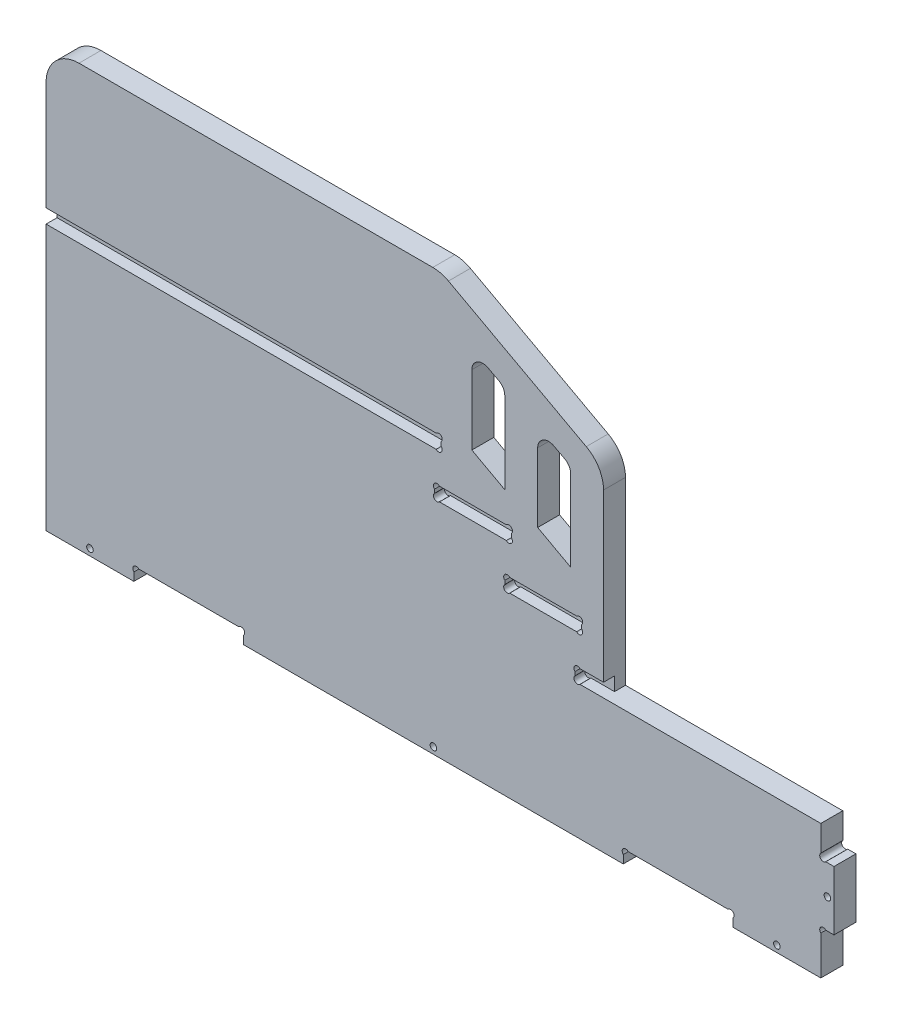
ISO-10303-21;
HEADER;
FILE_DESCRIPTION(('STEP AP214'),'2;1');
FILE_NAME('part.step','',(''),(''),'','','');
FILE_SCHEMA(('AUTOMOTIVE_DESIGN { 1 0 10303 214 1 1 1 1 }'));
ENDSEC;
DATA;
#1=APPLICATION_CONTEXT('core data for automotive mechanical design processes');
#2=APPLICATION_PROTOCOL_DEFINITION('international standard','automotive_design',2000,#1);
#3=PRODUCT_CONTEXT('',#1,'mechanical');
#4=PRODUCT('Part','Part','',(#3));
#5=PRODUCT_RELATED_PRODUCT_CATEGORY('part','',(#4));
#6=PRODUCT_DEFINITION_FORMATION('','',#4);
#7=PRODUCT_DEFINITION_CONTEXT('part definition',#1,'design');
#8=PRODUCT_DEFINITION('design','',#6,#7);
#9=PRODUCT_DEFINITION_SHAPE('','',#8);
#10=(LENGTH_UNIT() NAMED_UNIT(*) SI_UNIT(.MILLI.,.METRE.));
#11=(NAMED_UNIT(*) PLANE_ANGLE_UNIT() SI_UNIT($,.RADIAN.));
#12=(NAMED_UNIT(*) SI_UNIT($,.STERADIAN.) SOLID_ANGLE_UNIT());
#13=UNCERTAINTY_MEASURE_WITH_UNIT(LENGTH_MEASURE(1.E-05),#10,'distance_accuracy_value','');
#14=(GEOMETRIC_REPRESENTATION_CONTEXT(3) GLOBAL_UNCERTAINTY_ASSIGNED_CONTEXT((#13)) GLOBAL_UNIT_ASSIGNED_CONTEXT((#10,
#11,#12)) REPRESENTATION_CONTEXT('',''));
#15=CARTESIAN_POINT('',(0.,0.,0.));
#16=DIRECTION('',(0.,0.,1.));
#17=DIRECTION('',(1.,0.,0.));
#18=AXIS2_PLACEMENT_3D('',#15,#16,#17);
#19=CARTESIAN_POINT('',(294.761857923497,-27.7466666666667,10.));
#20=DIRECTION('',(-1.,0.,0.));
#21=DIRECTION('',(0.,0.,1.));
#22=AXIS2_PLACEMENT_3D('',#19,#20,#21);
#23=PLANE('',#22);
#24=DIRECTION('',(0.,1.,0.));
#25=VECTOR('',#24,1.);
#26=CARTESIAN_POINT('',(294.761857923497,-27.7466666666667,10.));
#27=LINE('',#26,#25);
#28=CARTESIAN_POINT('',(294.761857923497,-39.4847716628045,10.));
#29=VERTEX_POINT('',#28);
#30=CARTESIAN_POINT('',(294.761857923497,-27.7466666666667,10.));
#31=VERTEX_POINT('',#30);
#32=EDGE_CURVE('E901',#29,#31,#27,.T.);
#33=ORIENTED_EDGE('',*,*,#32,.F.);
#34=DIRECTION('',(0.,0.,1.));
#35=VECTOR('',#34,1.);
#36=CARTESIAN_POINT('',(294.761857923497,-39.4847716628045,0.));
#37=LINE('',#36,#35);
#38=CARTESIAN_POINT('',(294.761857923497,-39.4847716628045,0.));
#39=VERTEX_POINT('',#38);
#40=EDGE_CURVE('E692',#29,#39,#37,.F.);
#41=ORIENTED_EDGE('',*,*,#40,.T.);
#42=DIRECTION('',(0.,1.,0.));
#43=VECTOR('',#42,1.);
#44=CARTESIAN_POINT('',(294.761857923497,-27.7466666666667,0.));
#45=LINE('',#44,#43);
#46=CARTESIAN_POINT('',(294.761857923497,-27.7466666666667,0.));
#47=VERTEX_POINT('',#46);
#48=EDGE_CURVE('E879',#39,#47,#45,.T.);
#49=ORIENTED_EDGE('',*,*,#48,.T.);
#50=DIRECTION('',(0.,0.,-1.));
#51=VECTOR('',#50,1.);
#52=CARTESIAN_POINT('',(294.761857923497,-27.7466666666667,10.));
#53=LINE('',#52,#51);
#54=EDGE_CURVE('E1255',#31,#47,#53,.T.);
#55=ORIENTED_EDGE('',*,*,#54,.F.);
#56=EDGE_LOOP('',(#33,#41,#49,#55));
#57=FACE_BOUND('',#56,.T.);
#58=ADVANCED_FACE('F32',(#57),#23,.F.);
#59=CARTESIAN_POINT('',(294.761857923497,-88.7466666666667,0.));
#60=VERTEX_POINT('',#59);
#61=CARTESIAN_POINT('',(294.761857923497,-71.0085616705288,0.));
#62=VERTEX_POINT('',#61);
#63=EDGE_CURVE('E890',#60,#62,#45,.T.);
#64=ORIENTED_EDGE('',*,*,#63,.T.);
#65=DIRECTION('',(0.,0.,1.));
#66=VECTOR('',#65,1.);
#67=CARTESIAN_POINT('',(294.761857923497,-71.0085616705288,0.));
#68=LINE('',#67,#66);
#69=CARTESIAN_POINT('',(294.761857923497,-71.0085616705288,10.));
#70=VERTEX_POINT('',#69);
#71=EDGE_CURVE('E684',#62,#70,#68,.T.);
#72=ORIENTED_EDGE('',*,*,#71,.T.);
#73=CARTESIAN_POINT('',(294.761857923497,-88.7466666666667,10.));
#74=VERTEX_POINT('',#73);
#75=EDGE_CURVE('E896',#74,#70,#27,.T.);
#76=ORIENTED_EDGE('',*,*,#75,.F.);
#77=DIRECTION('',(0.,0.,-1.));
#78=VECTOR('',#77,1.);
#79=CARTESIAN_POINT('',(294.761857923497,-88.7466666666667,10.));
#80=LINE('',#79,#78);
#81=EDGE_CURVE('E1037',#74,#60,#80,.T.);
#82=ORIENTED_EDGE('',*,*,#81,.T.);
#83=EDGE_LOOP('',(#64,#72,#76,#82));
#84=FACE_BOUND('',#83,.T.);
#85=ADVANCED_FACE('F1001',(#84),#23,.F.);
#86=CARTESIAN_POINT('',(-58.2381420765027,-88.7466666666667,10.));
#87=DIRECTION('',(0.,1.,0.));
#88=DIRECTION('',(0.,0.,1.));
#89=AXIS2_PLACEMENT_3D('',#86,#87,#88);
#90=PLANE('',#89);
#91=DIRECTION('',(1.,0.,0.));
#92=VECTOR('',#91,1.);
#93=CARTESIAN_POINT('',(-58.2381420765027,-88.7466666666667,0.));
#94=LINE('',#93,#92);
#95=CARTESIAN_POINT('',(-58.2381420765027,-88.7466666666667,0.));
#96=VERTEX_POINT('',#95);
#97=CARTESIAN_POINT('',(-18.2381420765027,-88.7466666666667,0.));
#98=VERTEX_POINT('',#97);
#99=EDGE_CURVE('E876',#96,#98,#94,.T.);
#100=ORIENTED_EDGE('',*,*,#99,.T.);
#101=DIRECTION('',(0.,0.,1.));
#102=VECTOR('',#101,1.);
#103=CARTESIAN_POINT('',(-18.2381420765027,-88.7466666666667,0.));
#104=LINE('',#103,#102);
#105=CARTESIAN_POINT('',(-18.2381420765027,-88.7466666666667,10.));
#106=VERTEX_POINT('',#105);
#107=EDGE_CURVE('E770',#98,#106,#104,.T.);
#108=ORIENTED_EDGE('',*,*,#107,.T.);
#109=DIRECTION('',(1.,0.,0.));
#110=VECTOR('',#109,1.);
#111=CARTESIAN_POINT('',(-58.2381420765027,-88.7466666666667,10.));
#112=LINE('',#111,#110);
#113=CARTESIAN_POINT('',(-58.2381420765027,-88.7466666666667,10.));
#114=VERTEX_POINT('',#113);
#115=EDGE_CURVE('E907',#114,#106,#112,.T.);
#116=ORIENTED_EDGE('',*,*,#115,.F.);
#117=DIRECTION('',(0.,0.,-1.));
#118=VECTOR('',#117,1.);
#119=CARTESIAN_POINT('',(-58.2381420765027,-88.7466666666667,10.));
#120=LINE('',#119,#118);
#121=EDGE_CURVE('E1054',#114,#96,#120,.T.);
#122=ORIENTED_EDGE('',*,*,#121,.T.);
#123=EDGE_LOOP('',(#100,#108,#116,#122));
#124=FACE_BOUND('',#123,.T.);
#125=ADVANCED_FACE('F1007',(#124),#90,.F.);
#126=CARTESIAN_POINT('',(254.761857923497,-88.7466666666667,10.));
#127=VERTEX_POINT('',#126);
#128=EDGE_CURVE('E1034',#127,#74,#112,.T.);
#129=ORIENTED_EDGE('',*,*,#128,.F.);
#130=DIRECTION('',(0.,0.,1.));
#131=VECTOR('',#130,1.);
#132=CARTESIAN_POINT('',(254.761857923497,-88.7466666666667,0.));
#133=LINE('',#132,#131);
#134=CARTESIAN_POINT('',(254.761857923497,-88.7466666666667,0.));
#135=VERTEX_POINT('',#134);
#136=EDGE_CURVE('E792',#135,#127,#133,.T.);
#137=ORIENTED_EDGE('',*,*,#136,.F.);
#138=EDGE_CURVE('E875',#135,#60,#94,.T.);
#139=ORIENTED_EDGE('',*,*,#138,.T.);
#140=ORIENTED_EDGE('',*,*,#81,.F.);
#141=EDGE_LOOP('',(#129,#137,#139,#140));
#142=FACE_BOUND('',#141,.T.);
#143=ADVANCED_FACE('F1016',(#142),#90,.F.);
#144=CARTESIAN_POINT('',(-58.2381420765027,32.2533333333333,10.));
#145=DIRECTION('',(1.,0.,0.));
#146=DIRECTION('',(0.,1.,0.));
#147=AXIS2_PLACEMENT_3D('',#144,#145,#146);
#148=PLANE('',#147);
#149=DIRECTION('',(0.,-1.,0.));
#150=VECTOR('',#149,1.);
#151=CARTESIAN_POINT('',(-58.2381420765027,103.253333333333,10.));
#152=LINE('',#151,#150);
#153=CARTESIAN_POINT('',(-58.2381420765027,88.2533333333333,10.));
#154=VERTEX_POINT('',#153);
#155=CARTESIAN_POINT('',(-58.2381420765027,38.6533333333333,10.));
#156=VERTEX_POINT('',#155);
#157=EDGE_CURVE('E1042',#154,#156,#152,.T.);
#158=ORIENTED_EDGE('',*,*,#157,.F.);
#159=DIRECTION('',(0.,0.,-1.));
#160=VECTOR('',#159,1.);
#161=CARTESIAN_POINT('',(-58.2381420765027,88.2533333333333,10.));
#162=LINE('',#161,#160);
#163=CARTESIAN_POINT('',(-58.2381420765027,88.2533333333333,0.));
#164=VERTEX_POINT('',#163);
#165=EDGE_CURVE('E944',#154,#164,#162,.T.);
#166=ORIENTED_EDGE('',*,*,#165,.T.);
#167=DIRECTION('',(0.,-1.,0.));
#168=VECTOR('',#167,1.);
#169=CARTESIAN_POINT('',(-58.2381420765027,32.2533333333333,0.));
#170=LINE('',#169,#168);
#171=EDGE_CURVE('E873',#164,#96,#170,.T.);
#172=ORIENTED_EDGE('',*,*,#171,.T.);
#173=ORIENTED_EDGE('',*,*,#121,.F.);
#174=CARTESIAN_POINT('',(-58.2381420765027,32.2533333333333,10.));
#175=VERTEX_POINT('',#174);
#176=EDGE_CURVE('E1044',#175,#114,#152,.T.);
#177=ORIENTED_EDGE('',*,*,#176,.F.);
#178=DIRECTION('',(0.,0.,1.));
#179=VECTOR('',#178,1.);
#180=CARTESIAN_POINT('',(-58.2381420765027,32.2533333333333,5.));
#181=LINE('',#180,#179);
#182=CARTESIAN_POINT('',(-58.2381420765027,32.2533333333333,5.));
#183=VERTEX_POINT('',#182);
#184=EDGE_CURVE('E814',#183,#175,#181,.T.);
#185=ORIENTED_EDGE('',*,*,#184,.F.);
#186=DIRECTION('',(0.,-1.,0.));
#187=VECTOR('',#186,1.);
#188=CARTESIAN_POINT('',(-58.2381420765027,38.6533333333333,5.));
#189=LINE('',#188,#187);
#190=CARTESIAN_POINT('',(-58.2381420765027,38.6533333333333,5.));
#191=VERTEX_POINT('',#190);
#192=EDGE_CURVE('E804',#191,#183,#189,.T.);
#193=ORIENTED_EDGE('',*,*,#192,.F.);
#194=DIRECTION('',(0.,0.,1.));
#195=VECTOR('',#194,1.);
#196=CARTESIAN_POINT('',(-58.2381420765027,38.6533333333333,5.));
#197=LINE('',#196,#195);
#198=EDGE_CURVE('E815',#191,#156,#197,.T.);
#199=ORIENTED_EDGE('',*,*,#198,.T.);
#200=EDGE_LOOP('',(#158,#166,#172,#173,#177,#185,#193,#199));
#201=FACE_BOUND('',#200,.T.);
#202=ADVANCED_FACE('F34',(#201),#148,.F.);
#203=CARTESIAN_POINT('',(31.7618579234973,-88.7466666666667,10.));
#204=VERTEX_POINT('',#203);
#205=CARTESIAN_POINT('',(204.761857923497,-88.7466666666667,10.));
#206=VERTEX_POINT('',#205);
#207=EDGE_CURVE('E1041',#204,#206,#112,.T.);
#208=ORIENTED_EDGE('',*,*,#207,.F.);
#209=DIRECTION('',(0.,0.,1.));
#210=VECTOR('',#209,1.);
#211=CARTESIAN_POINT('',(31.7618579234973,-88.7466666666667,0.));
#212=LINE('',#211,#210);
#213=CARTESIAN_POINT('',(31.7618579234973,-88.7466666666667,0.));
#214=VERTEX_POINT('',#213);
#215=EDGE_CURVE('E771',#214,#204,#212,.T.);
#216=ORIENTED_EDGE('',*,*,#215,.F.);
#217=CARTESIAN_POINT('',(204.761857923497,-88.7466666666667,0.));
#218=VERTEX_POINT('',#217);
#219=EDGE_CURVE('E880',#214,#218,#94,.T.);
#220=ORIENTED_EDGE('',*,*,#219,.T.);
#221=DIRECTION('',(0.,0.,1.));
#222=VECTOR('',#221,1.);
#223=CARTESIAN_POINT('',(204.761857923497,-88.7466666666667,0.));
#224=LINE('',#223,#222);
#225=EDGE_CURVE('E791',#218,#206,#224,.T.);
#226=ORIENTED_EDGE('',*,*,#225,.T.);
#227=EDGE_LOOP('',(#208,#216,#220,#226));
#228=FACE_BOUND('',#227,.T.);
#229=ADVANCED_FACE('F1013',(#228),#90,.F.);
#230=CARTESIAN_POINT('',(294.761857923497,-27.7466666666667,10.));
#231=DIRECTION('',(0.,-1.,0.));
#232=DIRECTION('',(1.,0.,0.));
#233=AXIS2_PLACEMENT_3D('',#230,#231,#232);
#234=PLANE('',#233);
#235=DIRECTION('',(1.,0.,0.));
#236=VECTOR('',#235,1.);
#237=CARTESIAN_POINT('',(210.761857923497,-27.7466666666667,5.));
#238=LINE('',#237,#236);
#239=CARTESIAN_POINT('',(185.02375292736,-27.7466666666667,5.));
#240=VERTEX_POINT('',#239);
#241=CARTESIAN_POINT('',(195.761857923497,-27.7466666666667,5.));
#242=VERTEX_POINT('',#241);
#243=EDGE_CURVE('E831',#240,#242,#238,.T.);
#244=ORIENTED_EDGE('',*,*,#243,.F.);
#245=DIRECTION('',(0.,0.,1.));
#246=VECTOR('',#245,1.);
#247=CARTESIAN_POINT('',(185.023752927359,-27.7466666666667,5.));
#248=LINE('',#247,#246);
#249=CARTESIAN_POINT('',(185.023752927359,-27.7466666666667,10.));
#250=VERTEX_POINT('',#249);
#251=EDGE_CURVE('E633',#240,#250,#248,.T.);
#252=ORIENTED_EDGE('',*,*,#251,.T.);
#253=DIRECTION('',(-1.,0.,0.));
#254=VECTOR('',#253,1.);
#255=CARTESIAN_POINT('',(294.761857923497,-27.7466666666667,10.));
#256=LINE('',#255,#254);
#257=EDGE_CURVE('E900',#31,#250,#256,.T.);
#258=ORIENTED_EDGE('',*,*,#257,.F.);
#259=ORIENTED_EDGE('',*,*,#54,.T.);
#260=DIRECTION('',(-1.,0.,0.));
#261=VECTOR('',#260,1.);
#262=CARTESIAN_POINT('',(294.761857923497,-27.7466666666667,0.));
#263=LINE('',#262,#261);
#264=CARTESIAN_POINT('',(195.761857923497,-27.7466666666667,0.));
#265=VERTEX_POINT('',#264);
#266=EDGE_CURVE('E883',#47,#265,#263,.T.);
#267=ORIENTED_EDGE('',*,*,#266,.T.);
#268=DIRECTION('',(0.,0.,1.));
#269=VECTOR('',#268,1.);
#270=CARTESIAN_POINT('',(195.761857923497,-27.7466666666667,0.));
#271=LINE('',#270,#269);
#272=EDGE_CURVE('E748',#265,#242,#271,.T.);
#273=ORIENTED_EDGE('',*,*,#272,.T.);
#274=EDGE_LOOP('',(#244,#252,#258,#259,#267,#273));
#275=FACE_BOUND('',#274,.T.);
#276=ADVANCED_FACE('F1011',(#275),#234,.F.);
#277=CARTESIAN_POINT('',(-58.2381420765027,103.253333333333,10.));
#278=DIRECTION('',(0.,-1.,0.));
#279=DIRECTION('',(0.,0.,-1.));
#280=AXIS2_PLACEMENT_3D('',#277,#278,#279);
#281=PLANE('',#280);
#282=DIRECTION('',(-1.,0.,0.));
#283=VECTOR('',#282,1.);
#284=CARTESIAN_POINT('',(-58.2381420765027,103.253333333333,10.));
#285=LINE('',#284,#283);
#286=CARTESIAN_POINT('',(117.967246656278,103.253333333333,10.));
#287=VERTEX_POINT('',#286);
#288=CARTESIAN_POINT('',(-43.2381420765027,103.253333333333,10.));
#289=VERTEX_POINT('',#288);
#290=EDGE_CURVE('E1249',#287,#289,#285,.T.);
#291=ORIENTED_EDGE('',*,*,#290,.F.);
#292=DIRECTION('',(0.,0.,1.));
#293=VECTOR('',#292,1.);
#294=CARTESIAN_POINT('',(117.967246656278,103.253333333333,10.));
#295=LINE('',#294,#293);
#296=CARTESIAN_POINT('',(117.967246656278,103.253333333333,0.));
#297=VERTEX_POINT('',#296);
#298=EDGE_CURVE('E942',#287,#297,#295,.F.);
#299=ORIENTED_EDGE('',*,*,#298,.T.);
#300=DIRECTION('',(-1.,0.,0.));
#301=VECTOR('',#300,1.);
#302=CARTESIAN_POINT('',(-58.2381420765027,103.253333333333,0.));
#303=LINE('',#302,#301);
#304=CARTESIAN_POINT('',(-43.2381420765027,103.253333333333,0.));
#305=VERTEX_POINT('',#304);
#306=EDGE_CURVE('E1262',#297,#305,#303,.T.);
#307=ORIENTED_EDGE('',*,*,#306,.T.);
#308=DIRECTION('',(0.,0.,-1.));
#309=VECTOR('',#308,1.);
#310=CARTESIAN_POINT('',(-43.2381420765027,103.253333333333,10.));
#311=LINE('',#310,#309);
#312=EDGE_CURVE('E940',#305,#289,#311,.F.);
#313=ORIENTED_EDGE('',*,*,#312,.T.);
#314=EDGE_LOOP('',(#291,#299,#307,#313));
#315=FACE_BOUND('',#314,.T.);
#316=ADVANCED_FACE('F1021',(#315),#281,.F.);
#317=CARTESIAN_POINT('',(-58.2381420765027,-27.7466666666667,10.));
#318=DIRECTION('',(0.,0.,-1.));
#319=DIRECTION('',(-1.,0.,0.));
#320=AXIS2_PLACEMENT_3D('',#317,#318,#319);
#321=PLANE('',#320);
#322=DIRECTION('',(0.87890973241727,-0.476988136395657,0.));
#323=VECTOR('',#322,1.);
#324=CARTESIAN_POINT('',(150.761857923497,31.9406209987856,10.));
#325=LINE('',#324,#323);
#326=CARTESIAN_POINT('',(135.761857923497,40.0811862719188,10.));
#327=VERTEX_POINT('',#326);
#328=CARTESIAN_POINT('',(150.761857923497,31.9406209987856,10.));
#329=VERTEX_POINT('',#328);
#330=EDGE_CURVE('E466',#327,#329,#325,.T.);
#331=ORIENTED_EDGE('',*,*,#330,.F.);
#332=DIRECTION('',(0.,-1.,0.));
#333=VECTOR('',#332,1.);
#334=CARTESIAN_POINT('',(135.761857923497,40.0811862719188,10.));
#335=LINE('',#334,#333);
#336=CARTESIAN_POINT('',(135.761857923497,71.7933929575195,10.));
#337=VERTEX_POINT('',#336);
#338=EDGE_CURVE('E471',#337,#327,#335,.T.);
#339=ORIENTED_EDGE('',*,*,#338,.F.);
#340=CARTESIAN_POINT('',(140.761857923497,71.7933929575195,10.));
#341=DIRECTION('',(0.,0.,-1.));
#342=DIRECTION('',(-1.,0.,0.));
#343=AXIS2_PLACEMENT_3D('',#340,#341,#342);
#344=CIRCLE('',#343,5.);
#345=CARTESIAN_POINT('',(143.093412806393,76.2164972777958,10.));
#346=VERTEX_POINT('',#345);
#347=EDGE_CURVE('E40',#337,#346,#344,.T.);
#348=ORIENTED_EDGE('',*,*,#347,.T.);
#349=DIRECTION('',(-0.88462086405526,0.466310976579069,0.));
#350=VECTOR('',#349,1.);
#351=CARTESIAN_POINT('',(135.761857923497,80.0811862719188,10.));
#352=LINE('',#351,#350);
#353=CARTESIAN_POINT('',(148.093412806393,73.580842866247,10.));
#354=VERTEX_POINT('',#353);
#355=EDGE_CURVE('E477',#354,#346,#352,.T.);
#356=ORIENTED_EDGE('',*,*,#355,.F.);
#357=CARTESIAN_POINT('',(145.761857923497,69.1577385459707,10.));
#358=DIRECTION('',(0.,0.,-1.));
#359=DIRECTION('',(-1.,0.,0.));
#360=AXIS2_PLACEMENT_3D('',#357,#358,#359);
#361=CIRCLE('',#360,5.);
#362=CARTESIAN_POINT('',(150.761857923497,69.1577385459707,10.));
#363=VERTEX_POINT('',#362);
#364=EDGE_CURVE('E476',#354,#363,#361,.T.);
#365=ORIENTED_EDGE('',*,*,#364,.T.);
#366=DIRECTION('',(0.,1.,0.));
#367=VECTOR('',#366,1.);
#368=CARTESIAN_POINT('',(150.761857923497,72.1742230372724,10.));
#369=LINE('',#368,#367);
#370=EDGE_CURVE('E454',#329,#363,#369,.T.);
#371=ORIENTED_EDGE('',*,*,#370,.F.);
#372=EDGE_LOOP('',(#331,#339,#348,#356,#365,#371));
#373=FACE_BOUND('',#372,.T.);
#374=DIRECTION('',(-0.88462086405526,0.466310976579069,0.));
#375=VECTOR('',#374,1.);
#376=CARTESIAN_POINT('',(180.761857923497,56.3602965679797,10.));
#377=LINE('',#376,#375);
#378=CARTESIAN_POINT('',(178.093412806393,57.7669163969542,10.));
#379=VERTEX_POINT('',#378);
#380=CARTESIAN_POINT('',(173.093412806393,60.402570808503,10.));
#381=VERTEX_POINT('',#380);
#382=EDGE_CURVE('E493',#379,#381,#377,.T.);
#383=ORIENTED_EDGE('',*,*,#382,.F.);
#384=CARTESIAN_POINT('',(175.761857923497,53.3438120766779,10.));
#385=DIRECTION('',(0.,0.,-1.));
#386=DIRECTION('',(-1.,0.,0.));
#387=AXIS2_PLACEMENT_3D('',#384,#385,#386);
#388=CIRCLE('',#387,5.);
#389=CARTESIAN_POINT('',(180.761857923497,53.3438120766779,10.));
#390=VERTEX_POINT('',#389);
#391=EDGE_CURVE('E966',#379,#390,#388,.T.);
#392=ORIENTED_EDGE('',*,*,#391,.T.);
#393=DIRECTION('',(0.,1.,0.));
#394=VECTOR('',#393,1.);
#395=CARTESIAN_POINT('',(180.761857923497,16.3602965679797,10.));
#396=LINE('',#395,#394);
#397=CARTESIAN_POINT('',(180.761857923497,16.3602965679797,10.));
#398=VERTEX_POINT('',#397);
#399=EDGE_CURVE('E461',#398,#390,#396,.T.);
#400=ORIENTED_EDGE('',*,*,#399,.F.);
#401=DIRECTION('',(0.878297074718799,-0.478115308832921,0.));
#402=VECTOR('',#401,1.);
#403=CARTESIAN_POINT('',(165.761857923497,24.5257907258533,10.));
#404=LINE('',#403,#402);
#405=CARTESIAN_POINT('',(165.761857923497,24.5257907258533,10.));
#406=VERTEX_POINT('',#405);
#407=EDGE_CURVE('E498',#406,#398,#404,.T.);
#408=ORIENTED_EDGE('',*,*,#407,.F.);
#409=DIRECTION('',(0.,-1.,0.));
#410=VECTOR('',#409,1.);
#411=CARTESIAN_POINT('',(165.761857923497,64.2672598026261,10.));
#412=LINE('',#411,#410);
#413=CARTESIAN_POINT('',(165.761857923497,55.9794664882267,10.));
#414=VERTEX_POINT('',#413);
#415=EDGE_CURVE('E496',#414,#406,#412,.T.);
#416=ORIENTED_EDGE('',*,*,#415,.F.);
#417=CARTESIAN_POINT('',(170.761857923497,55.9794664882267,10.));
#418=DIRECTION('',(0.,0.,-1.));
#419=DIRECTION('',(-1.,0.,0.));
#420=AXIS2_PLACEMENT_3D('',#417,#418,#419);
#421=CIRCLE('',#420,5.);
#422=EDGE_CURVE('E973',#414,#381,#421,.T.);
#423=ORIENTED_EDGE('',*,*,#422,.T.);
#424=EDGE_LOOP('',(#383,#392,#400,#408,#416,#423));
#425=FACE_BOUND('',#424,.T.);
#426=CARTESIAN_POINT('',(297.761857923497,-55.2466666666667,10.));
#427=DIRECTION('',(0.,0.,1.));
#428=DIRECTION('',(1.,0.,0.));
#429=AXIS2_PLACEMENT_3D('',#426,#427,#428);
#430=CIRCLE('',#429,1.50000000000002);
#431=CARTESIAN_POINT('',(299.261857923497,-55.2466666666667,10.));
#432=VERTEX_POINT('',#431);
#433=EDGE_CURVE('E655',#432,#432,#430,.T.);
#434=ORIENTED_EDGE('',*,*,#433,.F.);
#435=EDGE_LOOP('',(#434));
#436=FACE_BOUND('',#435,.T.);
#437=CARTESIAN_POINT('',(274.761857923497,-85.7466666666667,10.));
#438=DIRECTION('',(0.,0.,1.));
#439=DIRECTION('',(1.,0.,0.));
#440=AXIS2_PLACEMENT_3D('',#437,#438,#439);
#441=CIRCLE('',#440,1.50000000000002);
#442=CARTESIAN_POINT('',(276.261857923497,-85.7466666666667,10.));
#443=VERTEX_POINT('',#442);
#444=EDGE_CURVE('E661',#443,#443,#441,.T.);
#445=ORIENTED_EDGE('',*,*,#444,.F.);
#446=EDGE_LOOP('',(#445));
#447=FACE_BOUND('',#446,.T.);
#448=CARTESIAN_POINT('',(118.261857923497,-85.7466666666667,10.));
#449=DIRECTION('',(0.,0.,1.));
#450=DIRECTION('',(1.,0.,0.));
#451=AXIS2_PLACEMENT_3D('',#448,#449,#450);
#452=CIRCLE('',#451,1.5);
#453=CARTESIAN_POINT('',(119.761857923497,-85.7466666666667,10.));
#454=VERTEX_POINT('',#453);
#455=EDGE_CURVE('E667',#454,#454,#452,.T.);
#456=ORIENTED_EDGE('',*,*,#455,.F.);
#457=EDGE_LOOP('',(#456));
#458=FACE_BOUND('',#457,.T.);
#459=CARTESIAN_POINT('',(-38.2381420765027,-85.7466666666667,10.));
#460=DIRECTION('',(0.,0.,1.));
#461=DIRECTION('',(1.,0.,0.));
#462=AXIS2_PLACEMENT_3D('',#459,#460,#461);
#463=CIRCLE('',#462,1.5);
#464=CARTESIAN_POINT('',(-36.7381420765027,-85.7466666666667,10.));
#465=VERTEX_POINT('',#464);
#466=EDGE_CURVE('E673',#465,#465,#463,.T.);
#467=ORIENTED_EDGE('',*,*,#466,.F.);
#468=EDGE_LOOP('',(#467));
#469=FACE_BOUND('',#468,.T.);
#470=DIRECTION('',(1.,0.,0.));
#471=VECTOR('',#470,1.);
#472=CARTESIAN_POINT('',(153.761857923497,12.2533333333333,10.));
#473=LINE('',#472,#471);
#474=CARTESIAN_POINT('',(121.02375292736,12.2533333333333,10.));
#475=VERTEX_POINT('',#474);
#476=CARTESIAN_POINT('',(151.499962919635,12.2533333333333,10.));
#477=VERTEX_POINT('',#476);
#478=EDGE_CURVE('E841',#475,#477,#473,.T.);
#479=ORIENTED_EDGE('',*,*,#478,.F.);
#480=CARTESIAN_POINT('',(119.861857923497,13.3533333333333,10.));
#481=DIRECTION('',(0.,0.,1.));
#482=DIRECTION('',(1.,0.,0.));
#483=AXIS2_PLACEMENT_3D('',#480,#481,#482);
#484=CIRCLE('',#483,1.6);
#485=CARTESIAN_POINT('',(118.761857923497,14.5152283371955,10.));
#486=VERTEX_POINT('',#485);
#487=EDGE_CURVE('E539',#486,#475,#484,.T.);
#488=ORIENTED_EDGE('',*,*,#487,.F.);
#489=DIRECTION('',(0.,-1.,0.));
#490=VECTOR('',#489,1.);
#491=CARTESIAN_POINT('',(118.761857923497,12.2533333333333,10.));
#492=LINE('',#491,#490);
#493=CARTESIAN_POINT('',(118.761857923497,16.1914383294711,10.));
#494=VERTEX_POINT('',#493);
#495=EDGE_CURVE('E838',#494,#486,#492,.T.);
#496=ORIENTED_EDGE('',*,*,#495,.F.);
#497=CARTESIAN_POINT('',(119.861857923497,17.3533333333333,10.));
#498=DIRECTION('',(0.,0.,1.));
#499=DIRECTION('',(1.,0.,0.));
#500=AXIS2_PLACEMENT_3D('',#497,#498,#499);
#501=CIRCLE('',#500,1.6);
#502=CARTESIAN_POINT('',(121.02375292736,18.4533333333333,10.));
#503=VERTEX_POINT('',#502);
#504=EDGE_CURVE('E550',#503,#494,#501,.T.);
#505=ORIENTED_EDGE('',*,*,#504,.F.);
#506=DIRECTION('',(-1.,0.,0.));
#507=VECTOR('',#506,1.);
#508=CARTESIAN_POINT('',(153.761857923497,18.4533333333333,10.));
#509=LINE('',#508,#507);
#510=CARTESIAN_POINT('',(151.499962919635,18.4533333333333,10.));
#511=VERTEX_POINT('',#510);
#512=EDGE_CURVE('E835',#511,#503,#509,.T.);
#513=ORIENTED_EDGE('',*,*,#512,.F.);
#514=CARTESIAN_POINT('',(152.661857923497,17.3533333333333,10.));
#515=DIRECTION('',(0.,0.,1.));
#516=DIRECTION('',(1.,0.,0.));
#517=AXIS2_PLACEMENT_3D('',#514,#515,#516);
#518=CIRCLE('',#517,1.59999999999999);
#519=CARTESIAN_POINT('',(153.761857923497,16.1914383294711,10.));
#520=VERTEX_POINT('',#519);
#521=EDGE_CURVE('E572',#520,#511,#518,.T.);
#522=ORIENTED_EDGE('',*,*,#521,.F.);
#523=DIRECTION('',(0.,1.,0.));
#524=VECTOR('',#523,1.);
#525=CARTESIAN_POINT('',(153.761857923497,12.2533333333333,10.));
#526=LINE('',#525,#524);
#527=CARTESIAN_POINT('',(153.761857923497,14.5152283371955,10.));
#528=VERTEX_POINT('',#527);
#529=EDGE_CURVE('E833',#528,#520,#526,.T.);
#530=ORIENTED_EDGE('',*,*,#529,.F.);
#531=CARTESIAN_POINT('',(152.661857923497,13.3533333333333,10.));
#532=DIRECTION('',(0.,0.,1.));
#533=DIRECTION('',(1.,0.,0.));
#534=AXIS2_PLACEMENT_3D('',#531,#532,#533);
#535=CIRCLE('',#534,1.59999999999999);
#536=EDGE_CURVE('E561',#477,#528,#535,.T.);
#537=ORIENTED_EDGE('',*,*,#536,.F.);
#538=EDGE_LOOP('',(#479,#488,#496,#505,#513,#522,#530,#537));
#539=FACE_BOUND('',#538,.T.);
#540=DIRECTION('',(1.,0.,0.));
#541=VECTOR('',#540,1.);
#542=CARTESIAN_POINT('',(185.761857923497,-7.74666666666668,10.));
#543=LINE('',#542,#541);
#544=CARTESIAN_POINT('',(153.02375292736,-7.74666666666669,10.));
#545=VERTEX_POINT('',#544);
#546=CARTESIAN_POINT('',(183.499962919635,-7.74666666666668,10.));
#547=VERTEX_POINT('',#546);
#548=EDGE_CURVE('E861',#545,#547,#543,.T.);
#549=ORIENTED_EDGE('',*,*,#548,.F.);
#550=CARTESIAN_POINT('',(151.861857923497,-6.64666666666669,10.));
#551=DIRECTION('',(0.,0.,1.));
#552=DIRECTION('',(1.,0.,0.));
#553=AXIS2_PLACEMENT_3D('',#550,#551,#552);
#554=CIRCLE('',#553,1.59999999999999);
#555=CARTESIAN_POINT('',(150.761857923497,-5.48477166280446,10.));
#556=VERTEX_POINT('',#555);
#557=EDGE_CURVE('E582',#556,#545,#554,.T.);
#558=ORIENTED_EDGE('',*,*,#557,.F.);
#559=DIRECTION('',(0.,-1.,0.));
#560=VECTOR('',#559,1.);
#561=CARTESIAN_POINT('',(150.761857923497,-7.74666666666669,10.));
#562=LINE('',#561,#560);
#563=CARTESIAN_POINT('',(150.761857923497,-3.80856167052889,10.));
#564=VERTEX_POINT('',#563);
#565=EDGE_CURVE('E858',#564,#556,#562,.T.);
#566=ORIENTED_EDGE('',*,*,#565,.F.);
#567=CARTESIAN_POINT('',(151.861857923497,-2.64666666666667,10.));
#568=DIRECTION('',(0.,0.,1.));
#569=DIRECTION('',(1.,0.,0.));
#570=AXIS2_PLACEMENT_3D('',#567,#568,#569);
#571=CIRCLE('',#570,1.59999999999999);
#572=CARTESIAN_POINT('',(153.02375292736,-1.54666666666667,10.));
#573=VERTEX_POINT('',#572);
#574=EDGE_CURVE('E593',#573,#564,#571,.T.);
#575=ORIENTED_EDGE('',*,*,#574,.F.);
#576=DIRECTION('',(-1.,0.,0.));
#577=VECTOR('',#576,1.);
#578=CARTESIAN_POINT('',(185.761857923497,-1.54666666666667,10.));
#579=LINE('',#578,#577);
#580=CARTESIAN_POINT('',(183.499962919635,-1.54666666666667,10.));
#581=VERTEX_POINT('',#580);
#582=EDGE_CURVE('E855',#581,#573,#579,.T.);
#583=ORIENTED_EDGE('',*,*,#582,.F.);
#584=CARTESIAN_POINT('',(184.661857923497,-2.64666666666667,10.));
#585=DIRECTION('',(0.,0.,1.));
#586=DIRECTION('',(1.,0.,0.));
#587=AXIS2_PLACEMENT_3D('',#584,#585,#586);
#588=CIRCLE('',#587,1.59999999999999);
#589=CARTESIAN_POINT('',(185.761857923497,-3.80856167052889,10.));
#590=VERTEX_POINT('',#589);
#591=EDGE_CURVE('E615',#590,#581,#588,.T.);
#592=ORIENTED_EDGE('',*,*,#591,.F.);
#593=DIRECTION('',(0.,1.,0.));
#594=VECTOR('',#593,1.);
#595=CARTESIAN_POINT('',(185.761857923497,-7.74666666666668,10.));
#596=LINE('',#595,#594);
#597=CARTESIAN_POINT('',(185.761857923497,-5.48477166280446,10.));
#598=VERTEX_POINT('',#597);
#599=EDGE_CURVE('E853',#598,#590,#596,.T.);
#600=ORIENTED_EDGE('',*,*,#599,.F.);
#601=CARTESIAN_POINT('',(184.661857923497,-6.64666666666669,10.));
#602=DIRECTION('',(0.,0.,1.));
#603=DIRECTION('',(1.,0.,0.));
#604=AXIS2_PLACEMENT_3D('',#601,#602,#603);
#605=CIRCLE('',#604,1.59999999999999);
#606=EDGE_CURVE('E604',#547,#598,#605,.T.);
#607=ORIENTED_EDGE('',*,*,#606,.F.);
#608=EDGE_LOOP('',(#549,#558,#566,#575,#583,#592,#600,#607));
#609=FACE_BOUND('',#608,.T.);
#610=DIRECTION('',(0.,-1.,0.));
#611=VECTOR('',#610,1.);
#612=CARTESIAN_POINT('',(195.761857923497,-27.7466666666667,10.));
#613=LINE('',#612,#611);
#614=CARTESIAN_POINT('',(195.761857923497,54.3103002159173,10.));
#615=VERTEX_POINT('',#614);
#616=CARTESIAN_POINT('',(195.761857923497,-21.5466666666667,10.));
#617=VERTEX_POINT('',#616);
#618=EDGE_CURVE('E740',#615,#617,#613,.T.);
#619=ORIENTED_EDGE('',*,*,#618,.F.);
#620=CARTESIAN_POINT('',(180.761857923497,54.3103002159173,10.));
#621=DIRECTION('',(0.,0.,-1.));
#622=DIRECTION('',(-1.,0.,0.));
#623=AXIS2_PLACEMENT_3D('',#620,#621,#622);
#624=CIRCLE('',#623,15.);
#625=CARTESIAN_POINT('',(187.894613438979,67.5058979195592,10.));
#626=VERTEX_POINT('',#625);
#627=EDGE_CURVE('E927',#615,#626,#624,.F.);
#628=ORIENTED_EDGE('',*,*,#627,.T.);
#629=DIRECTION('',(0.879706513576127,-0.475517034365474,0.));
#630=VECTOR('',#629,1.);
#631=CARTESIAN_POINT('',(195.761857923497,63.2533333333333,10.));
#632=LINE('',#631,#630);
#633=CARTESIAN_POINT('',(125.10000217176,101.448931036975,10.));
#634=VERTEX_POINT('',#633);
#635=EDGE_CURVE('E737',#634,#626,#632,.T.);
#636=ORIENTED_EDGE('',*,*,#635,.F.);
#637=CARTESIAN_POINT('',(117.967246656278,88.2533333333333,10.));
#638=DIRECTION('',(0.,0.,-1.));
#639=DIRECTION('',(-1.,0.,0.));
#640=AXIS2_PLACEMENT_3D('',#637,#638,#639);
#641=CIRCLE('',#640,15.);
#642=EDGE_CURVE('E925',#634,#287,#641,.F.);
#643=ORIENTED_EDGE('',*,*,#642,.T.);
#644=ORIENTED_EDGE('',*,*,#290,.T.);
#645=CARTESIAN_POINT('',(-43.2381420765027,88.2533333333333,10.));
#646=DIRECTION('',(0.,0.,-1.));
#647=DIRECTION('',(-1.,0.,0.));
#648=AXIS2_PLACEMENT_3D('',#645,#646,#647);
#649=CIRCLE('',#648,15.);
#650=EDGE_CURVE('E923',#289,#154,#649,.F.);
#651=ORIENTED_EDGE('',*,*,#650,.T.);
#652=ORIENTED_EDGE('',*,*,#157,.T.);
#653=DIRECTION('',(-1.,0.,0.));
#654=VECTOR('',#653,1.);
#655=CARTESIAN_POINT('',(-58.2381420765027,38.6533333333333,10.));
#656=LINE('',#655,#654);
#657=CARTESIAN_POINT('',(119.499962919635,38.6533333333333,10.));
#658=VERTEX_POINT('',#657);
#659=EDGE_CURVE('E801',#658,#156,#656,.T.);
#660=ORIENTED_EDGE('',*,*,#659,.F.);
#661=CARTESIAN_POINT('',(120.661857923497,37.5533333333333,10.));
#662=DIRECTION('',(0.,0.,1.));
#663=DIRECTION('',(1.,0.,0.));
#664=AXIS2_PLACEMENT_3D('',#661,#662,#663);
#665=CIRCLE('',#664,1.60000000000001);
#666=CARTESIAN_POINT('',(121.761857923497,36.3914383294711,10.));
#667=VERTEX_POINT('',#666);
#668=EDGE_CURVE('E528',#667,#658,#665,.T.);
#669=ORIENTED_EDGE('',*,*,#668,.F.);
#670=DIRECTION('',(0.,1.,0.));
#671=VECTOR('',#670,1.);
#672=CARTESIAN_POINT('',(121.761857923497,38.6533333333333,10.));
#673=LINE('',#672,#671);
#674=CARTESIAN_POINT('',(121.761857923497,34.5152283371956,10.));
#675=VERTEX_POINT('',#674);
#676=EDGE_CURVE('E799',#675,#667,#673,.T.);
#677=ORIENTED_EDGE('',*,*,#676,.F.);
#678=CARTESIAN_POINT('',(120.661857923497,33.3533333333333,10.));
#679=DIRECTION('',(0.,0.,1.));
#680=DIRECTION('',(1.,0.,0.));
#681=AXIS2_PLACEMENT_3D('',#678,#679,#680);
#682=CIRCLE('',#681,1.60000000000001);
#683=CARTESIAN_POINT('',(119.499962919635,32.2533333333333,10.));
#684=VERTEX_POINT('',#683);
#685=EDGE_CURVE('E515',#684,#675,#682,.T.);
#686=ORIENTED_EDGE('',*,*,#685,.F.);
#687=DIRECTION('',(1.,0.,0.));
#688=VECTOR('',#687,1.);
#689=CARTESIAN_POINT('',(-58.2381420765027,32.2533333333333,10.));
#690=LINE('',#689,#688);
#691=EDGE_CURVE('E794',#175,#684,#690,.T.);
#692=ORIENTED_EDGE('',*,*,#691,.F.);
#693=ORIENTED_EDGE('',*,*,#176,.T.);
#694=ORIENTED_EDGE('',*,*,#115,.T.);
#695=DIRECTION('',(0.,-1.,0.));
#696=VECTOR('',#695,1.);
#697=CARTESIAN_POINT('',(-18.2381420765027,-88.7466666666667,10.));
#698=LINE('',#697,#696);
#699=CARTESIAN_POINT('',(-18.2381420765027,-85.0085616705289,10.));
#700=VERTEX_POINT('',#699);
#701=EDGE_CURVE('E754',#700,#106,#698,.T.);
#702=ORIENTED_EDGE('',*,*,#701,.F.);
#703=CARTESIAN_POINT('',(-17.1381420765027,-83.8466666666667,10.));
#704=DIRECTION('',(0.,0.,1.));
#705=DIRECTION('',(1.,0.,0.));
#706=AXIS2_PLACEMENT_3D('',#703,#704,#705);
#707=CIRCLE('',#706,1.60000000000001);
#708=CARTESIAN_POINT('',(-15.9762470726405,-82.7466666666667,10.));
#709=VERTEX_POINT('',#708);
#710=EDGE_CURVE('E695',#709,#700,#707,.T.);
#711=ORIENTED_EDGE('',*,*,#710,.F.);
#712=DIRECTION('',(-1.,0.,0.));
#713=VECTOR('',#712,1.);
#714=CARTESIAN_POINT('',(-18.2381420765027,-82.7466666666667,10.));
#715=LINE('',#714,#713);
#716=CARTESIAN_POINT('',(29.4999629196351,-82.7466666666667,10.));
#717=VERTEX_POINT('',#716);
#718=EDGE_CURVE('E759',#717,#709,#715,.T.);
#719=ORIENTED_EDGE('',*,*,#718,.F.);
#720=CARTESIAN_POINT('',(30.6618579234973,-83.8466666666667,10.));
#721=DIRECTION('',(0.,0.,1.));
#722=DIRECTION('',(1.,0.,0.));
#723=AXIS2_PLACEMENT_3D('',#720,#721,#722);
#724=CIRCLE('',#723,1.60000000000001);
#725=CARTESIAN_POINT('',(31.7618579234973,-85.0085616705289,10.));
#726=VERTEX_POINT('',#725);
#727=EDGE_CURVE('E703',#726,#717,#724,.T.);
#728=ORIENTED_EDGE('',*,*,#727,.F.);
#729=DIRECTION('',(0.,1.,0.));
#730=VECTOR('',#729,1.);
#731=CARTESIAN_POINT('',(31.7618579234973,-88.7466666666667,10.));
#732=LINE('',#731,#730);
#733=EDGE_CURVE('E756',#204,#726,#732,.T.);
#734=ORIENTED_EDGE('',*,*,#733,.F.);
#735=ORIENTED_EDGE('',*,*,#207,.T.);
#736=DIRECTION('',(0.,-1.,0.));
#737=VECTOR('',#736,1.);
#738=CARTESIAN_POINT('',(204.761857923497,-88.7466666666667,10.));
#739=LINE('',#738,#737);
#740=CARTESIAN_POINT('',(204.761857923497,-85.0085616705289,10.));
#741=VERTEX_POINT('',#740);
#742=EDGE_CURVE('E781',#741,#206,#739,.T.);
#743=ORIENTED_EDGE('',*,*,#742,.F.);
#744=CARTESIAN_POINT('',(205.861857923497,-83.8466666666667,10.));
#745=DIRECTION('',(0.,0.,1.));
#746=DIRECTION('',(1.,0.,0.));
#747=AXIS2_PLACEMENT_3D('',#744,#745,#746);
#748=CIRCLE('',#747,1.59999999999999);
#749=CARTESIAN_POINT('',(207.02375292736,-82.7466666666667,10.));
#750=VERTEX_POINT('',#749);
#751=EDGE_CURVE('E711',#750,#741,#748,.T.);
#752=ORIENTED_EDGE('',*,*,#751,.F.);
#753=DIRECTION('',(-1.,0.,0.));
#754=VECTOR('',#753,1.);
#755=CARTESIAN_POINT('',(254.761857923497,-82.7466666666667,10.));
#756=LINE('',#755,#754);
#757=CARTESIAN_POINT('',(252.499962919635,-82.7466666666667,10.));
#758=VERTEX_POINT('',#757);
#759=EDGE_CURVE('E778',#758,#750,#756,.T.);
#760=ORIENTED_EDGE('',*,*,#759,.F.);
#761=CARTESIAN_POINT('',(253.661857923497,-83.8466666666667,10.));
#762=DIRECTION('',(0.,0.,1.));
#763=DIRECTION('',(1.,0.,0.));
#764=AXIS2_PLACEMENT_3D('',#761,#762,#763);
#765=CIRCLE('',#764,1.59999999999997);
#766=CARTESIAN_POINT('',(254.761857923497,-85.0085616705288,10.));
#767=VERTEX_POINT('',#766);
#768=EDGE_CURVE('E719',#767,#758,#765,.T.);
#769=ORIENTED_EDGE('',*,*,#768,.F.);
#770=DIRECTION('',(0.,1.,0.));
#771=VECTOR('',#770,1.);
#772=CARTESIAN_POINT('',(254.761857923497,-88.7466666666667,10.));
#773=LINE('',#772,#771);
#774=EDGE_CURVE('E773',#127,#767,#773,.T.);
#775=ORIENTED_EDGE('',*,*,#774,.F.);
#776=ORIENTED_EDGE('',*,*,#128,.T.);
#777=ORIENTED_EDGE('',*,*,#75,.T.);
#778=CARTESIAN_POINT('',(295.861857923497,-69.8466666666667,10.));
#779=DIRECTION('',(0.,0.,1.));
#780=DIRECTION('',(1.,0.,0.));
#781=AXIS2_PLACEMENT_3D('',#778,#779,#780);
#782=CIRCLE('',#781,1.59999999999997);
#783=CARTESIAN_POINT('',(297.023752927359,-68.7466666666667,10.));
#784=VERTEX_POINT('',#783);
#785=EDGE_CURVE('E679',#784,#70,#782,.T.);
#786=ORIENTED_EDGE('',*,*,#785,.F.);
#787=DIRECTION('',(-1.,0.,0.));
#788=VECTOR('',#787,1.);
#789=CARTESIAN_POINT('',(300.761857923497,-68.7466666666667,10.));
#790=LINE('',#789,#788);
#791=CARTESIAN_POINT('',(300.761857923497,-68.7466666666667,10.));
#792=VERTEX_POINT('',#791);
#793=EDGE_CURVE('E741',#792,#784,#790,.T.);
#794=ORIENTED_EDGE('',*,*,#793,.F.);
#795=DIRECTION('',(0.,-1.,0.));
#796=VECTOR('',#795,1.);
#797=CARTESIAN_POINT('',(300.761857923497,-41.7466666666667,10.));
#798=LINE('',#797,#796);
#799=CARTESIAN_POINT('',(300.761857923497,-41.7466666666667,10.));
#800=VERTEX_POINT('',#799);
#801=EDGE_CURVE('E727',#800,#792,#798,.T.);
#802=ORIENTED_EDGE('',*,*,#801,.F.);
#803=DIRECTION('',(-1.,0.,0.));
#804=VECTOR('',#803,1.);
#805=CARTESIAN_POINT('',(300.761857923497,-41.7466666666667,10.));
#806=LINE('',#805,#804);
#807=CARTESIAN_POINT('',(297.023752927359,-41.7466666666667,10.));
#808=VERTEX_POINT('',#807);
#809=EDGE_CURVE('E736',#800,#808,#806,.T.);
#810=ORIENTED_EDGE('',*,*,#809,.T.);
#811=CARTESIAN_POINT('',(295.861857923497,-40.6466666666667,10.));
#812=DIRECTION('',(0.,0.,1.));
#813=DIRECTION('',(1.,0.,0.));
#814=AXIS2_PLACEMENT_3D('',#811,#812,#813);
#815=CIRCLE('',#814,1.59999999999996);
#816=EDGE_CURVE('E687',#29,#808,#815,.T.);
#817=ORIENTED_EDGE('',*,*,#816,.F.);
#818=ORIENTED_EDGE('',*,*,#32,.T.);
#819=ORIENTED_EDGE('',*,*,#257,.T.);
#820=CARTESIAN_POINT('',(183.861857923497,-26.6466666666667,10.));
#821=DIRECTION('',(0.,0.,1.));
#822=DIRECTION('',(1.,0.,0.));
#823=AXIS2_PLACEMENT_3D('',#820,#821,#822);
#824=CIRCLE('',#823,1.59999999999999);
#825=CARTESIAN_POINT('',(182.761857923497,-25.4847716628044,10.));
#826=VERTEX_POINT('',#825);
#827=EDGE_CURVE('E625',#826,#250,#824,.T.);
#828=ORIENTED_EDGE('',*,*,#827,.F.);
#829=DIRECTION('',(0.,-1.,0.));
#830=VECTOR('',#829,1.);
#831=CARTESIAN_POINT('',(182.761857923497,-27.7466666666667,10.));
#832=LINE('',#831,#830);
#833=CARTESIAN_POINT('',(182.761857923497,-23.8085616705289,10.));
#834=VERTEX_POINT('',#833);
#835=EDGE_CURVE('E822',#834,#826,#832,.T.);
#836=ORIENTED_EDGE('',*,*,#835,.F.);
#837=CARTESIAN_POINT('',(183.861857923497,-22.6466666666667,10.));
#838=DIRECTION('',(0.,0.,1.));
#839=DIRECTION('',(1.,0.,0.));
#840=AXIS2_PLACEMENT_3D('',#837,#838,#839);
#841=CIRCLE('',#840,1.59999999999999);
#842=CARTESIAN_POINT('',(185.02375292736,-21.5466666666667,10.));
#843=VERTEX_POINT('',#842);
#844=EDGE_CURVE('E636',#843,#834,#841,.T.);
#845=ORIENTED_EDGE('',*,*,#844,.F.);
#846=DIRECTION('',(-1.,0.,0.));
#847=VECTOR('',#846,1.);
#848=CARTESIAN_POINT('',(210.761857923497,-21.5466666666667,10.));
#849=LINE('',#848,#847);
#850=EDGE_CURVE('E818',#617,#843,#849,.T.);
#851=ORIENTED_EDGE('',*,*,#850,.F.);
#852=EDGE_LOOP('',(#619,#628,#636,#643,#644,#651,#652,#660,#669,#677,#686,#692,#693,#694,#702,
#711,#719,#728,#734,#735,#743,#752,#760,#769,#775,#776,#777,#786,#794,#802,#810,#817,#818,#819,
#828,#836,#845,#851));
#853=FACE_BOUND('',#852,.T.);
#854=ADVANCED_FACE('F473',(#373,#425,#436,#447,#458,#469,#539,#609,#853),#321,.F.);
#855=CARTESIAN_POINT('',(-58.2381420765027,-27.7466666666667,0.));
#856=DIRECTION('',(0.,0.,-1.));
#857=DIRECTION('',(-1.,0.,0.));
#858=AXIS2_PLACEMENT_3D('',#855,#856,#857);
#859=PLANE('',#858);
#860=DIRECTION('',(-0.88462086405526,0.466310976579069,0.));
#861=VECTOR('',#860,1.);
#862=CARTESIAN_POINT('',(135.761857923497,80.0811862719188,0.));
#863=LINE('',#862,#861);
#864=CARTESIAN_POINT('',(148.093412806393,73.580842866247,0.));
#865=VERTEX_POINT('',#864);
#866=CARTESIAN_POINT('',(143.093412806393,76.2164972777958,0.));
#867=VERTEX_POINT('',#866);
#868=EDGE_CURVE('E488',#865,#867,#863,.T.);
#869=ORIENTED_EDGE('',*,*,#868,.T.);
#870=CARTESIAN_POINT('',(140.761857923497,71.7933929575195,0.));
#871=DIRECTION('',(0.,0.,-1.));
#872=DIRECTION('',(-1.,0.,0.));
#873=AXIS2_PLACEMENT_3D('',#870,#871,#872);
#874=CIRCLE('',#873,5.);
#875=CARTESIAN_POINT('',(135.761857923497,71.7933929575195,0.));
#876=VERTEX_POINT('',#875);
#877=EDGE_CURVE('E11',#867,#876,#874,.F.);
#878=ORIENTED_EDGE('',*,*,#877,.T.);
#879=DIRECTION('',(0.,-1.,0.));
#880=VECTOR('',#879,1.);
#881=CARTESIAN_POINT('',(135.761857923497,40.0811862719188,0.));
#882=LINE('',#881,#880);
#883=CARTESIAN_POINT('',(135.761857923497,40.0811862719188,0.));
#884=VERTEX_POINT('',#883);
#885=EDGE_CURVE('E480',#876,#884,#882,.T.);
#886=ORIENTED_EDGE('',*,*,#885,.T.);
#887=DIRECTION('',(0.87890973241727,-0.476988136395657,0.));
#888=VECTOR('',#887,1.);
#889=CARTESIAN_POINT('',(150.761857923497,31.9406209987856,0.));
#890=LINE('',#889,#888);
#891=CARTESIAN_POINT('',(150.761857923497,31.9406209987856,0.));
#892=VERTEX_POINT('',#891);
#893=EDGE_CURVE('E485',#884,#892,#890,.T.);
#894=ORIENTED_EDGE('',*,*,#893,.T.);
#895=DIRECTION('',(0.,1.,0.));
#896=VECTOR('',#895,1.);
#897=CARTESIAN_POINT('',(150.761857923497,72.1742230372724,0.));
#898=LINE('',#897,#896);
#899=CARTESIAN_POINT('',(150.761857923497,69.1577385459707,0.));
#900=VERTEX_POINT('',#899);
#901=EDGE_CURVE('E457',#892,#900,#898,.T.);
#902=ORIENTED_EDGE('',*,*,#901,.T.);
#903=CARTESIAN_POINT('',(145.761857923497,69.1577385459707,0.));
#904=DIRECTION('',(0.,0.,-1.));
#905=DIRECTION('',(-1.,0.,0.));
#906=AXIS2_PLACEMENT_3D('',#903,#904,#905);
#907=CIRCLE('',#906,5.);
#908=EDGE_CURVE('E971',#900,#865,#907,.F.);
#909=ORIENTED_EDGE('',*,*,#908,.T.);
#910=EDGE_LOOP('',(#869,#878,#886,#894,#902,#909));
#911=FACE_BOUND('',#910,.T.);
#912=DIRECTION('',(0.,1.,0.));
#913=VECTOR('',#912,1.);
#914=CARTESIAN_POINT('',(180.761857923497,16.3602965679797,0.));
#915=LINE('',#914,#913);
#916=CARTESIAN_POINT('',(180.761857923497,16.3602965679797,0.));
#917=VERTEX_POINT('',#916);
#918=CARTESIAN_POINT('',(180.761857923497,53.3438120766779,0.));
#919=VERTEX_POINT('',#918);
#920=EDGE_CURVE('E501',#917,#919,#915,.T.);
#921=ORIENTED_EDGE('',*,*,#920,.T.);
#922=CARTESIAN_POINT('',(175.761857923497,53.3438120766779,0.));
#923=DIRECTION('',(0.,0.,-1.));
#924=DIRECTION('',(-1.,0.,0.));
#925=AXIS2_PLACEMENT_3D('',#922,#923,#924);
#926=CIRCLE('',#925,5.);
#927=CARTESIAN_POINT('',(178.093412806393,57.7669163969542,0.));
#928=VERTEX_POINT('',#927);
#929=EDGE_CURVE('E968',#919,#928,#926,.F.);
#930=ORIENTED_EDGE('',*,*,#929,.T.);
#931=DIRECTION('',(-0.88462086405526,0.466310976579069,0.));
#932=VECTOR('',#931,1.);
#933=CARTESIAN_POINT('',(180.761857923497,56.3602965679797,0.));
#934=LINE('',#933,#932);
#935=CARTESIAN_POINT('',(173.093412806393,60.402570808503,0.));
#936=VERTEX_POINT('',#935);
#937=EDGE_CURVE('E504',#928,#936,#934,.T.);
#938=ORIENTED_EDGE('',*,*,#937,.T.);
#939=CARTESIAN_POINT('',(170.761857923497,55.9794664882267,0.));
#940=DIRECTION('',(0.,0.,-1.));
#941=DIRECTION('',(-1.,0.,0.));
#942=AXIS2_PLACEMENT_3D('',#939,#940,#941);
#943=CIRCLE('',#942,5.);
#944=CARTESIAN_POINT('',(165.761857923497,55.9794664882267,0.));
#945=VERTEX_POINT('',#944);
#946=EDGE_CURVE('E975',#936,#945,#943,.F.);
#947=ORIENTED_EDGE('',*,*,#946,.T.);
#948=DIRECTION('',(0.,-1.,0.));
#949=VECTOR('',#948,1.);
#950=CARTESIAN_POINT('',(165.761857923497,64.2672598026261,0.));
#951=LINE('',#950,#949);
#952=CARTESIAN_POINT('',(165.761857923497,24.5257907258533,0.));
#953=VERTEX_POINT('',#952);
#954=EDGE_CURVE('E507',#945,#953,#951,.T.);
#955=ORIENTED_EDGE('',*,*,#954,.T.);
#956=DIRECTION('',(0.878297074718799,-0.478115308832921,0.));
#957=VECTOR('',#956,1.);
#958=CARTESIAN_POINT('',(165.761857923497,24.5257907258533,0.));
#959=LINE('',#958,#957);
#960=EDGE_CURVE('E509',#953,#917,#959,.T.);
#961=ORIENTED_EDGE('',*,*,#960,.T.);
#962=EDGE_LOOP('',(#921,#930,#938,#947,#955,#961));
#963=FACE_BOUND('',#962,.T.);
#964=CARTESIAN_POINT('',(136.261857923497,15.3533333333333,0.));
#965=DIRECTION('',(0.,0.,1.));
#966=DIRECTION('',(1.,0.,0.));
#967=AXIS2_PLACEMENT_3D('',#964,#965,#966);
#968=CIRCLE('',#967,1.5);
#969=CARTESIAN_POINT('',(137.761857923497,15.3533333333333,0.));
#970=VERTEX_POINT('',#969);
#971=EDGE_CURVE('E647',#970,#970,#968,.T.);
#972=ORIENTED_EDGE('',*,*,#971,.T.);
#973=EDGE_LOOP('',(#972));
#974=FACE_BOUND('',#973,.T.);
#975=CARTESIAN_POINT('',(168.261857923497,-4.64666666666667,0.));
#976=DIRECTION('',(0.,0.,1.));
#977=DIRECTION('',(1.,0.,0.));
#978=AXIS2_PLACEMENT_3D('',#975,#976,#977);
#979=CIRCLE('',#978,1.5);
#980=CARTESIAN_POINT('',(169.761857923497,-4.64666666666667,0.));
#981=VERTEX_POINT('',#980);
#982=EDGE_CURVE('E651',#981,#981,#979,.T.);
#983=ORIENTED_EDGE('',*,*,#982,.T.);
#984=EDGE_LOOP('',(#983));
#985=FACE_BOUND('',#984,.T.);
#986=CARTESIAN_POINT('',(297.761857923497,-55.2466666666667,0.));
#987=DIRECTION('',(0.,0.,1.));
#988=DIRECTION('',(1.,0.,0.));
#989=AXIS2_PLACEMENT_3D('',#986,#987,#988);
#990=CIRCLE('',#989,1.50000000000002);
#991=CARTESIAN_POINT('',(299.261857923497,-55.2466666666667,0.));
#992=VERTEX_POINT('',#991);
#993=EDGE_CURVE('E658',#992,#992,#990,.T.);
#994=ORIENTED_EDGE('',*,*,#993,.T.);
#995=EDGE_LOOP('',(#994));
#996=FACE_BOUND('',#995,.T.);
#997=CARTESIAN_POINT('',(274.761857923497,-85.7466666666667,0.));
#998=DIRECTION('',(0.,0.,1.));
#999=DIRECTION('',(1.,0.,0.));
#1000=AXIS2_PLACEMENT_3D('',#997,#998,#999);
#1001=CIRCLE('',#1000,1.50000000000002);
#1002=CARTESIAN_POINT('',(276.261857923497,-85.7466666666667,0.));
#1003=VERTEX_POINT('',#1002);
#1004=EDGE_CURVE('E664',#1003,#1003,#1001,.T.);
#1005=ORIENTED_EDGE('',*,*,#1004,.T.);
#1006=EDGE_LOOP('',(#1005));
#1007=FACE_BOUND('',#1006,.T.);
#1008=CARTESIAN_POINT('',(118.261857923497,-85.7466666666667,0.));
#1009=DIRECTION('',(0.,0.,1.));
#1010=DIRECTION('',(1.,0.,0.));
#1011=AXIS2_PLACEMENT_3D('',#1008,#1009,#1010);
#1012=CIRCLE('',#1011,1.5);
#1013=CARTESIAN_POINT('',(119.761857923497,-85.7466666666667,0.));
#1014=VERTEX_POINT('',#1013);
#1015=EDGE_CURVE('E670',#1014,#1014,#1012,.T.);
#1016=ORIENTED_EDGE('',*,*,#1015,.T.);
#1017=EDGE_LOOP('',(#1016));
#1018=FACE_BOUND('',#1017,.T.);
#1019=CARTESIAN_POINT('',(-38.2381420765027,-85.7466666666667,0.));
#1020=DIRECTION('',(0.,0.,1.));
#1021=DIRECTION('',(1.,0.,0.));
#1022=AXIS2_PLACEMENT_3D('',#1019,#1020,#1021);
#1023=CIRCLE('',#1022,1.5);
#1024=CARTESIAN_POINT('',(-36.7381420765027,-85.7466666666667,0.));
#1025=VERTEX_POINT('',#1024);
#1026=EDGE_CURVE('E676',#1025,#1025,#1023,.T.);
#1027=ORIENTED_EDGE('',*,*,#1026,.T.);
#1028=EDGE_LOOP('',(#1027));
#1029=FACE_BOUND('',#1028,.T.);
#1030=DIRECTION('',(0.879706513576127,-0.475517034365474,0.));
#1031=VECTOR('',#1030,1.);
#1032=CARTESIAN_POINT('',(195.761857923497,63.2533333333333,0.));
#1033=LINE('',#1032,#1031);
#1034=CARTESIAN_POINT('',(125.10000217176,101.448931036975,0.));
#1035=VERTEX_POINT('',#1034);
#1036=CARTESIAN_POINT('',(187.894613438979,67.5058979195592,0.));
#1037=VERTEX_POINT('',#1036);
#1038=EDGE_CURVE('E743',#1035,#1037,#1033,.T.);
#1039=ORIENTED_EDGE('',*,*,#1038,.T.);
#1040=CARTESIAN_POINT('',(180.761857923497,54.3103002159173,0.));
#1041=DIRECTION('',(0.,0.,-1.));
#1042=DIRECTION('',(-1.,0.,0.));
#1043=AXIS2_PLACEMENT_3D('',#1040,#1041,#1042);
#1044=CIRCLE('',#1043,15.);
#1045=CARTESIAN_POINT('',(195.761857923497,54.3103002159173,0.));
#1046=VERTEX_POINT('',#1045);
#1047=EDGE_CURVE('E938',#1037,#1046,#1044,.T.);
#1048=ORIENTED_EDGE('',*,*,#1047,.T.);
#1049=DIRECTION('',(0.,-1.,0.));
#1050=VECTOR('',#1049,1.);
#1051=CARTESIAN_POINT('',(195.761857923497,-27.7466666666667,0.));
#1052=LINE('',#1051,#1050);
#1053=EDGE_CURVE('E746',#1046,#265,#1052,.T.);
#1054=ORIENTED_EDGE('',*,*,#1053,.T.);
#1055=ORIENTED_EDGE('',*,*,#266,.F.);
#1056=ORIENTED_EDGE('',*,*,#48,.F.);
#1057=CARTESIAN_POINT('',(295.861857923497,-40.6466666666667,0.));
#1058=DIRECTION('',(0.,0.,1.));
#1059=DIRECTION('',(1.,0.,0.));
#1060=AXIS2_PLACEMENT_3D('',#1057,#1058,#1059);
#1061=CIRCLE('',#1060,1.59999999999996);
#1062=CARTESIAN_POINT('',(297.023752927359,-41.7466666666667,0.));
#1063=VERTEX_POINT('',#1062);
#1064=EDGE_CURVE('E689',#39,#1063,#1061,.T.);
#1065=ORIENTED_EDGE('',*,*,#1064,.T.);
#1066=DIRECTION('',(-1.,0.,0.));
#1067=VECTOR('',#1066,1.);
#1068=CARTESIAN_POINT('',(300.761857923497,-41.7466666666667,0.));
#1069=LINE('',#1068,#1067);
#1070=CARTESIAN_POINT('',(300.761857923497,-41.7466666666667,0.));
#1071=VERTEX_POINT('',#1070);
#1072=EDGE_CURVE('E1083',#1071,#1063,#1069,.T.);
#1073=ORIENTED_EDGE('',*,*,#1072,.F.);
#1074=DIRECTION('',(0.,1.,0.));
#1075=VECTOR('',#1074,1.);
#1076=CARTESIAN_POINT('',(300.761857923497,-41.7466666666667,0.));
#1077=LINE('',#1076,#1075);
#1078=CARTESIAN_POINT('',(300.761857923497,-68.7466666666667,0.));
#1079=VERTEX_POINT('',#1078);
#1080=EDGE_CURVE('E732',#1079,#1071,#1077,.T.);
#1081=ORIENTED_EDGE('',*,*,#1080,.F.);
#1082=DIRECTION('',(-1.,0.,0.));
#1083=VECTOR('',#1082,1.);
#1084=CARTESIAN_POINT('',(300.761857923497,-68.7466666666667,0.));
#1085=LINE('',#1084,#1083);
#1086=CARTESIAN_POINT('',(297.023752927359,-68.7466666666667,0.));
#1087=VERTEX_POINT('',#1086);
#1088=EDGE_CURVE('E902',#1079,#1087,#1085,.T.);
#1089=ORIENTED_EDGE('',*,*,#1088,.T.);
#1090=CARTESIAN_POINT('',(295.861857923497,-69.8466666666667,0.));
#1091=DIRECTION('',(0.,0.,1.));
#1092=DIRECTION('',(1.,0.,0.));
#1093=AXIS2_PLACEMENT_3D('',#1090,#1091,#1092);
#1094=CIRCLE('',#1093,1.59999999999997);
#1095=EDGE_CURVE('E681',#1087,#62,#1094,.T.);
#1096=ORIENTED_EDGE('',*,*,#1095,.T.);
#1097=ORIENTED_EDGE('',*,*,#63,.F.);
#1098=ORIENTED_EDGE('',*,*,#138,.F.);
#1099=DIRECTION('',(0.,1.,0.));
#1100=VECTOR('',#1099,1.);
#1101=CARTESIAN_POINT('',(254.761857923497,-88.7466666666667,0.));
#1102=LINE('',#1101,#1100);
#1103=CARTESIAN_POINT('',(254.761857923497,-85.0085616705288,0.));
#1104=VERTEX_POINT('',#1103);
#1105=EDGE_CURVE('E783',#135,#1104,#1102,.T.);
#1106=ORIENTED_EDGE('',*,*,#1105,.T.);
#1107=CARTESIAN_POINT('',(253.661857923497,-83.8466666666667,0.));
#1108=DIRECTION('',(0.,0.,1.));
#1109=DIRECTION('',(1.,0.,0.));
#1110=AXIS2_PLACEMENT_3D('',#1107,#1108,#1109);
#1111=CIRCLE('',#1110,1.59999999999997);
#1112=CARTESIAN_POINT('',(252.499962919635,-82.7466666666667,0.));
#1113=VERTEX_POINT('',#1112);
#1114=EDGE_CURVE('E721',#1104,#1113,#1111,.T.);
#1115=ORIENTED_EDGE('',*,*,#1114,.T.);
#1116=DIRECTION('',(-1.,0.,0.));
#1117=VECTOR('',#1116,1.);
#1118=CARTESIAN_POINT('',(254.761857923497,-82.7466666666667,0.));
#1119=LINE('',#1118,#1117);
#1120=CARTESIAN_POINT('',(207.02375292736,-82.7466666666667,0.));
#1121=VERTEX_POINT('',#1120);
#1122=EDGE_CURVE('E786',#1113,#1121,#1119,.T.);
#1123=ORIENTED_EDGE('',*,*,#1122,.T.);
#1124=CARTESIAN_POINT('',(205.861857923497,-83.8466666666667,0.));
#1125=DIRECTION('',(0.,0.,1.));
#1126=DIRECTION('',(1.,0.,0.));
#1127=AXIS2_PLACEMENT_3D('',#1124,#1125,#1126);
#1128=CIRCLE('',#1127,1.59999999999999);
#1129=CARTESIAN_POINT('',(204.761857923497,-85.0085616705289,0.));
#1130=VERTEX_POINT('',#1129);
#1131=EDGE_CURVE('E713',#1121,#1130,#1128,.T.);
#1132=ORIENTED_EDGE('',*,*,#1131,.T.);
#1133=DIRECTION('',(0.,-1.,0.));
#1134=VECTOR('',#1133,1.);
#1135=CARTESIAN_POINT('',(204.761857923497,-88.7466666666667,0.));
#1136=LINE('',#1135,#1134);
#1137=EDGE_CURVE('E789',#1130,#218,#1136,.T.);
#1138=ORIENTED_EDGE('',*,*,#1137,.T.);
#1139=ORIENTED_EDGE('',*,*,#219,.F.);
#1140=DIRECTION('',(0.,1.,0.));
#1141=VECTOR('',#1140,1.);
#1142=CARTESIAN_POINT('',(31.7618579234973,-88.7466666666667,0.));
#1143=LINE('',#1142,#1141);
#1144=CARTESIAN_POINT('',(31.7618579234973,-85.0085616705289,0.));
#1145=VERTEX_POINT('',#1144);
#1146=EDGE_CURVE('E764',#214,#1145,#1143,.T.);
#1147=ORIENTED_EDGE('',*,*,#1146,.T.);
#1148=CARTESIAN_POINT('',(30.6618579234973,-83.8466666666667,0.));
#1149=DIRECTION('',(0.,0.,1.));
#1150=DIRECTION('',(1.,0.,0.));
#1151=AXIS2_PLACEMENT_3D('',#1148,#1149,#1150);
#1152=CIRCLE('',#1151,1.60000000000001);
#1153=CARTESIAN_POINT('',(29.4999629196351,-82.7466666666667,0.));
#1154=VERTEX_POINT('',#1153);
#1155=EDGE_CURVE('E705',#1145,#1154,#1152,.T.);
#1156=ORIENTED_EDGE('',*,*,#1155,.T.);
#1157=DIRECTION('',(-1.,0.,0.));
#1158=VECTOR('',#1157,1.);
#1159=CARTESIAN_POINT('',(-18.2381420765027,-82.7466666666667,0.));
#1160=LINE('',#1159,#1158);
#1161=CARTESIAN_POINT('',(-15.9762470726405,-82.7466666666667,0.));
#1162=VERTEX_POINT('',#1161);
#1163=EDGE_CURVE('E767',#1154,#1162,#1160,.T.);
#1164=ORIENTED_EDGE('',*,*,#1163,.T.);
#1165=CARTESIAN_POINT('',(-17.1381420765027,-83.8466666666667,0.));
#1166=DIRECTION('',(0.,0.,1.));
#1167=DIRECTION('',(1.,0.,0.));
#1168=AXIS2_PLACEMENT_3D('',#1165,#1166,#1167);
#1169=CIRCLE('',#1168,1.60000000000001);
#1170=CARTESIAN_POINT('',(-18.2381420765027,-85.0085616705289,0.));
#1171=VERTEX_POINT('',#1170);
#1172=EDGE_CURVE('E697',#1162,#1171,#1169,.T.);
#1173=ORIENTED_EDGE('',*,*,#1172,.T.);
#1174=DIRECTION('',(0.,-1.,0.));
#1175=VECTOR('',#1174,1.);
#1176=CARTESIAN_POINT('',(-18.2381420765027,-88.7466666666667,0.));
#1177=LINE('',#1176,#1175);
#1178=EDGE_CURVE('E762',#1171,#98,#1177,.T.);
#1179=ORIENTED_EDGE('',*,*,#1178,.T.);
#1180=ORIENTED_EDGE('',*,*,#99,.F.);
#1181=ORIENTED_EDGE('',*,*,#171,.F.);
#1182=CARTESIAN_POINT('',(-43.2381420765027,88.2533333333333,0.));
#1183=DIRECTION('',(0.,0.,-1.));
#1184=DIRECTION('',(-1.,0.,0.));
#1185=AXIS2_PLACEMENT_3D('',#1182,#1183,#1184);
#1186=CIRCLE('',#1185,15.);
#1187=EDGE_CURVE('E934',#164,#305,#1186,.T.);
#1188=ORIENTED_EDGE('',*,*,#1187,.T.);
#1189=ORIENTED_EDGE('',*,*,#306,.F.);
#1190=CARTESIAN_POINT('',(117.967246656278,88.2533333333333,0.));
#1191=DIRECTION('',(0.,0.,-1.));
#1192=DIRECTION('',(-1.,0.,0.));
#1193=AXIS2_PLACEMENT_3D('',#1190,#1191,#1192);
#1194=CIRCLE('',#1193,15.);
#1195=EDGE_CURVE('E936',#297,#1035,#1194,.T.);
#1196=ORIENTED_EDGE('',*,*,#1195,.T.);
#1197=EDGE_LOOP('',(#1039,#1048,#1054,#1055,#1056,#1065,#1073,#1081,#1089,#1096,#1097,#1098,
#1106,#1115,#1123,#1132,#1138,#1139,#1147,#1156,#1164,#1173,#1179,#1180,#1181,#1188,#1189,#1196));
#1198=FACE_BOUND('',#1197,.T.);
#1199=ADVANCED_FACE('F983',(#911,#963,#974,#985,#996,#1007,#1018,#1029,#1198),#859,.T.);
#1200=CARTESIAN_POINT('',(185.761857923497,-7.74666666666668,5.));
#1201=DIRECTION('',(1.,0.,0.));
#1202=DIRECTION('',(0.,0.,-1.));
#1203=AXIS2_PLACEMENT_3D('',#1200,#1201,#1202);
#1204=PLANE('',#1203);
#1205=DIRECTION('',(0.,1.,0.));
#1206=VECTOR('',#1205,1.);
#1207=CARTESIAN_POINT('',(185.761857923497,-7.74666666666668,5.));
#1208=LINE('',#1207,#1206);
#1209=CARTESIAN_POINT('',(185.761857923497,-5.48477166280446,5.));
#1210=VERTEX_POINT('',#1209);
#1211=CARTESIAN_POINT('',(185.761857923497,-3.80856167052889,5.));
#1212=VERTEX_POINT('',#1211);
#1213=EDGE_CURVE('E863',#1210,#1212,#1208,.T.);
#1214=ORIENTED_EDGE('',*,*,#1213,.F.);
#1215=DIRECTION('',(0.,0.,1.));
#1216=VECTOR('',#1215,1.);
#1217=CARTESIAN_POINT('',(185.761857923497,-5.48477166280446,5.));
#1218=LINE('',#1217,#1216);
#1219=EDGE_CURVE('E612',#1210,#598,#1218,.T.);
#1220=ORIENTED_EDGE('',*,*,#1219,.T.);
#1221=ORIENTED_EDGE('',*,*,#599,.T.);
#1222=DIRECTION('',(0.,0.,1.));
#1223=VECTOR('',#1222,1.);
#1224=CARTESIAN_POINT('',(185.761857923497,-3.80856167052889,5.));
#1225=LINE('',#1224,#1223);
#1226=EDGE_CURVE('E622',#590,#1212,#1225,.F.);
#1227=ORIENTED_EDGE('',*,*,#1226,.T.);
#1228=EDGE_LOOP('',(#1214,#1220,#1221,#1227));
#1229=FACE_BOUND('',#1228,.T.);
#1230=ADVANCED_FACE('F1229',(#1229),#1204,.F.);
#1231=CARTESIAN_POINT('',(185.761857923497,-7.74666666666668,5.));
#1232=DIRECTION('',(0.,-1.,0.));
#1233=DIRECTION('',(1.,0.,0.));
#1234=AXIS2_PLACEMENT_3D('',#1231,#1232,#1233);
#1235=PLANE('',#1234);
#1236=DIRECTION('',(1.,0.,0.));
#1237=VECTOR('',#1236,1.);
#1238=CARTESIAN_POINT('',(185.761857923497,-7.74666666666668,5.));
#1239=LINE('',#1238,#1237);
#1240=CARTESIAN_POINT('',(153.02375292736,-7.74666666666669,5.));
#1241=VERTEX_POINT('',#1240);
#1242=CARTESIAN_POINT('',(183.499962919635,-7.74666666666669,5.));
#1243=VERTEX_POINT('',#1242);
#1244=EDGE_CURVE('E871',#1241,#1243,#1239,.T.);
#1245=ORIENTED_EDGE('',*,*,#1244,.F.);
#1246=DIRECTION('',(0.,0.,1.));
#1247=VECTOR('',#1246,1.);
#1248=CARTESIAN_POINT('',(153.02375292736,-7.74666666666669,5.));
#1249=LINE('',#1248,#1247);
#1250=EDGE_CURVE('E590',#1241,#545,#1249,.T.);
#1251=ORIENTED_EDGE('',*,*,#1250,.T.);
#1252=ORIENTED_EDGE('',*,*,#548,.T.);
#1253=DIRECTION('',(0.,0.,1.));
#1254=VECTOR('',#1253,1.);
#1255=CARTESIAN_POINT('',(183.499962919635,-7.74666666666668,5.));
#1256=LINE('',#1255,#1254);
#1257=EDGE_CURVE('E609',#547,#1243,#1256,.F.);
#1258=ORIENTED_EDGE('',*,*,#1257,.T.);
#1259=EDGE_LOOP('',(#1245,#1251,#1252,#1258));
#1260=FACE_BOUND('',#1259,.T.);
#1261=ADVANCED_FACE('F1225',(#1260),#1235,.F.);
#1262=CARTESIAN_POINT('',(150.761857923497,-7.74666666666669,5.));
#1263=DIRECTION('',(-1.,0.,0.));
#1264=DIRECTION('',(0.,0.,1.));
#1265=AXIS2_PLACEMENT_3D('',#1262,#1263,#1264);
#1266=PLANE('',#1265);
#1267=ORIENTED_EDGE('',*,*,#565,.T.);
#1268=DIRECTION('',(0.,0.,1.));
#1269=VECTOR('',#1268,1.);
#1270=CARTESIAN_POINT('',(150.761857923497,-5.48477166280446,5.));
#1271=LINE('',#1270,#1269);
#1272=CARTESIAN_POINT('',(150.761857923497,-5.48477166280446,5.));
#1273=VERTEX_POINT('',#1272);
#1274=EDGE_CURVE('E587',#556,#1273,#1271,.F.);
#1275=ORIENTED_EDGE('',*,*,#1274,.T.);
#1276=DIRECTION('',(0.,-1.,0.));
#1277=VECTOR('',#1276,1.);
#1278=CARTESIAN_POINT('',(150.761857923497,-7.74666666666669,5.));
#1279=LINE('',#1278,#1277);
#1280=CARTESIAN_POINT('',(150.761857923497,-3.80856167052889,5.));
#1281=VERTEX_POINT('',#1280);
#1282=EDGE_CURVE('E868',#1281,#1273,#1279,.T.);
#1283=ORIENTED_EDGE('',*,*,#1282,.F.);
#1284=DIRECTION('',(0.,0.,1.));
#1285=VECTOR('',#1284,1.);
#1286=CARTESIAN_POINT('',(150.761857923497,-3.80856167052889,5.));
#1287=LINE('',#1286,#1285);
#1288=EDGE_CURVE('E601',#1281,#564,#1287,.T.);
#1289=ORIENTED_EDGE('',*,*,#1288,.T.);
#1290=EDGE_LOOP('',(#1267,#1275,#1283,#1289));
#1291=FACE_BOUND('',#1290,.T.);
#1292=ADVANCED_FACE('F1228',(#1291),#1266,.F.);
#1293=CARTESIAN_POINT('',(185.761857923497,-1.54666666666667,5.));
#1294=DIRECTION('',(0.,1.,0.));
#1295=DIRECTION('',(-1.,0.,0.));
#1296=AXIS2_PLACEMENT_3D('',#1293,#1294,#1295);
#1297=PLANE('',#1296);
#1298=ORIENTED_EDGE('',*,*,#582,.T.);
#1299=DIRECTION('',(0.,0.,1.));
#1300=VECTOR('',#1299,1.);
#1301=CARTESIAN_POINT('',(153.02375292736,-1.54666666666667,5.));
#1302=LINE('',#1301,#1300);
#1303=CARTESIAN_POINT('',(153.02375292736,-1.54666666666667,5.));
#1304=VERTEX_POINT('',#1303);
#1305=EDGE_CURVE('E598',#573,#1304,#1302,.F.);
#1306=ORIENTED_EDGE('',*,*,#1305,.T.);
#1307=DIRECTION('',(-1.,0.,0.));
#1308=VECTOR('',#1307,1.);
#1309=CARTESIAN_POINT('',(185.761857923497,-1.54666666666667,5.));
#1310=LINE('',#1309,#1308);
#1311=CARTESIAN_POINT('',(183.499962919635,-1.54666666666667,5.));
#1312=VERTEX_POINT('',#1311);
#1313=EDGE_CURVE('E865',#1312,#1304,#1310,.T.);
#1314=ORIENTED_EDGE('',*,*,#1313,.F.);
#1315=DIRECTION('',(0.,0.,1.));
#1316=VECTOR('',#1315,1.);
#1317=CARTESIAN_POINT('',(183.499962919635,-1.54666666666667,5.));
#1318=LINE('',#1317,#1316);
#1319=EDGE_CURVE('E619',#1312,#581,#1318,.T.);
#1320=ORIENTED_EDGE('',*,*,#1319,.T.);
#1321=EDGE_LOOP('',(#1298,#1306,#1314,#1320));
#1322=FACE_BOUND('',#1321,.T.);
#1323=ADVANCED_FACE('F1223',(#1322),#1297,.F.);
#1324=CARTESIAN_POINT('',(185.761857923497,-1.54666666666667,5.));
#1325=DIRECTION('',(0.,0.,1.));
#1326=DIRECTION('',(1.,0.,0.));
#1327=AXIS2_PLACEMENT_3D('',#1324,#1325,#1326);
#1328=PLANE('',#1327);
#1329=CARTESIAN_POINT('',(151.861857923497,-6.64666666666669,5.));
#1330=DIRECTION('',(0.,0.,1.));
#1331=DIRECTION('',(1.,0.,0.));
#1332=AXIS2_PLACEMENT_3D('',#1329,#1330,#1331);
#1333=CIRCLE('',#1332,1.59999999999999);
#1334=EDGE_CURVE('E584',#1273,#1241,#1333,.T.);
#1335=ORIENTED_EDGE('',*,*,#1334,.T.);
#1336=ORIENTED_EDGE('',*,*,#1244,.T.);
#1337=CARTESIAN_POINT('',(184.661857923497,-6.64666666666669,5.));
#1338=DIRECTION('',(0.,0.,1.));
#1339=DIRECTION('',(1.,0.,0.));
#1340=AXIS2_PLACEMENT_3D('',#1337,#1338,#1339);
#1341=CIRCLE('',#1340,1.59999999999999);
#1342=EDGE_CURVE('E606',#1243,#1210,#1341,.T.);
#1343=ORIENTED_EDGE('',*,*,#1342,.T.);
#1344=ORIENTED_EDGE('',*,*,#1213,.T.);
#1345=CARTESIAN_POINT('',(184.661857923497,-2.64666666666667,5.));
#1346=DIRECTION('',(0.,0.,1.));
#1347=DIRECTION('',(1.,0.,0.));
#1348=AXIS2_PLACEMENT_3D('',#1345,#1346,#1347);
#1349=CIRCLE('',#1348,1.59999999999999);
#1350=EDGE_CURVE('E617',#1212,#1312,#1349,.T.);
#1351=ORIENTED_EDGE('',*,*,#1350,.T.);
#1352=ORIENTED_EDGE('',*,*,#1313,.T.);
#1353=CARTESIAN_POINT('',(151.861857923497,-2.64666666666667,5.));
#1354=DIRECTION('',(0.,0.,1.));
#1355=DIRECTION('',(1.,0.,0.));
#1356=AXIS2_PLACEMENT_3D('',#1353,#1354,#1355);
#1357=CIRCLE('',#1356,1.59999999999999);
#1358=EDGE_CURVE('E595',#1304,#1281,#1357,.T.);
#1359=ORIENTED_EDGE('',*,*,#1358,.T.);
#1360=ORIENTED_EDGE('',*,*,#1282,.T.);
#1361=EDGE_LOOP('',(#1335,#1336,#1343,#1344,#1351,#1352,#1359,#1360));
#1362=FACE_BOUND('',#1361,.T.);
#1363=CARTESIAN_POINT('',(168.261857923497,-4.64666666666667,5.));
#1364=DIRECTION('',(0.,0.,1.));
#1365=DIRECTION('',(1.,0.,0.));
#1366=AXIS2_PLACEMENT_3D('',#1363,#1364,#1365);
#1367=CIRCLE('',#1366,1.5);
#1368=CARTESIAN_POINT('',(169.761857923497,-4.64666666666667,5.));
#1369=VERTEX_POINT('',#1368);
#1370=EDGE_CURVE('E654',#1369,#1369,#1367,.T.);
#1371=ORIENTED_EDGE('',*,*,#1370,.F.);
#1372=EDGE_LOOP('',(#1371));
#1373=FACE_BOUND('',#1372,.T.);
#1374=ADVANCED_FACE('F1219',(#1362,#1373),#1328,.T.);
#1375=CARTESIAN_POINT('',(153.761857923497,12.2533333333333,5.));
#1376=DIRECTION('',(1.,0.,0.));
#1377=DIRECTION('',(0.,0.,-1.));
#1378=AXIS2_PLACEMENT_3D('',#1375,#1376,#1377);
#1379=PLANE('',#1378);
#1380=DIRECTION('',(0.,1.,0.));
#1381=VECTOR('',#1380,1.);
#1382=CARTESIAN_POINT('',(153.761857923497,12.2533333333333,5.));
#1383=LINE('',#1382,#1381);
#1384=CARTESIAN_POINT('',(153.761857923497,14.5152283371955,5.));
#1385=VERTEX_POINT('',#1384);
#1386=CARTESIAN_POINT('',(153.761857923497,16.1914383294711,5.));
#1387=VERTEX_POINT('',#1386);
#1388=EDGE_CURVE('E843',#1385,#1387,#1383,.T.);
#1389=ORIENTED_EDGE('',*,*,#1388,.F.);
#1390=DIRECTION('',(0.,0.,1.));
#1391=VECTOR('',#1390,1.);
#1392=CARTESIAN_POINT('',(153.761857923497,14.5152283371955,5.));
#1393=LINE('',#1392,#1391);
#1394=EDGE_CURVE('E569',#1385,#528,#1393,.T.);
#1395=ORIENTED_EDGE('',*,*,#1394,.T.);
#1396=ORIENTED_EDGE('',*,*,#529,.T.);
#1397=DIRECTION('',(0.,0.,1.));
#1398=VECTOR('',#1397,1.);
#1399=CARTESIAN_POINT('',(153.761857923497,16.1914383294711,5.));
#1400=LINE('',#1399,#1398);
#1401=EDGE_CURVE('E579',#520,#1387,#1400,.F.);
#1402=ORIENTED_EDGE('',*,*,#1401,.T.);
#1403=EDGE_LOOP('',(#1389,#1395,#1396,#1402));
#1404=FACE_BOUND('',#1403,.T.);
#1405=ADVANCED_FACE('F1209',(#1404),#1379,.F.);
#1406=CARTESIAN_POINT('',(153.761857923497,12.2533333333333,5.));
#1407=DIRECTION('',(0.,-1.,0.));
#1408=DIRECTION('',(1.,0.,0.));
#1409=AXIS2_PLACEMENT_3D('',#1406,#1407,#1408);
#1410=PLANE('',#1409);
#1411=DIRECTION('',(1.,0.,0.));
#1412=VECTOR('',#1411,1.);
#1413=CARTESIAN_POINT('',(153.761857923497,12.2533333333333,5.));
#1414=LINE('',#1413,#1412);
#1415=CARTESIAN_POINT('',(121.02375292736,12.2533333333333,5.));
#1416=VERTEX_POINT('',#1415);
#1417=CARTESIAN_POINT('',(151.499962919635,12.2533333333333,5.));
#1418=VERTEX_POINT('',#1417);
#1419=EDGE_CURVE('E851',#1416,#1418,#1414,.T.);
#1420=ORIENTED_EDGE('',*,*,#1419,.F.);
#1421=DIRECTION('',(0.,0.,1.));
#1422=VECTOR('',#1421,1.);
#1423=CARTESIAN_POINT('',(121.02375292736,12.2533333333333,5.));
#1424=LINE('',#1423,#1422);
#1425=EDGE_CURVE('E547',#1416,#475,#1424,.T.);
#1426=ORIENTED_EDGE('',*,*,#1425,.T.);
#1427=ORIENTED_EDGE('',*,*,#478,.T.);
#1428=DIRECTION('',(0.,0.,1.));
#1429=VECTOR('',#1428,1.);
#1430=CARTESIAN_POINT('',(151.499962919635,12.2533333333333,5.));
#1431=LINE('',#1430,#1429);
#1432=EDGE_CURVE('E566',#477,#1418,#1431,.F.);
#1433=ORIENTED_EDGE('',*,*,#1432,.T.);
#1434=EDGE_LOOP('',(#1420,#1426,#1427,#1433));
#1435=FACE_BOUND('',#1434,.T.);
#1436=ADVANCED_FACE('F1205',(#1435),#1410,.F.);
#1437=CARTESIAN_POINT('',(118.761857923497,12.2533333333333,5.));
#1438=DIRECTION('',(-1.,0.,0.));
#1439=DIRECTION('',(0.,0.,1.));
#1440=AXIS2_PLACEMENT_3D('',#1437,#1438,#1439);
#1441=PLANE('',#1440);
#1442=ORIENTED_EDGE('',*,*,#495,.T.);
#1443=DIRECTION('',(0.,0.,1.));
#1444=VECTOR('',#1443,1.);
#1445=CARTESIAN_POINT('',(118.761857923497,14.5152283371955,5.));
#1446=LINE('',#1445,#1444);
#1447=CARTESIAN_POINT('',(118.761857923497,14.5152283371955,5.));
#1448=VERTEX_POINT('',#1447);
#1449=EDGE_CURVE('E544',#486,#1448,#1446,.F.);
#1450=ORIENTED_EDGE('',*,*,#1449,.T.);
#1451=DIRECTION('',(0.,-1.,0.));
#1452=VECTOR('',#1451,1.);
#1453=CARTESIAN_POINT('',(118.761857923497,12.2533333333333,5.));
#1454=LINE('',#1453,#1452);
#1455=CARTESIAN_POINT('',(118.761857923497,16.1914383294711,5.));
#1456=VERTEX_POINT('',#1455);
#1457=EDGE_CURVE('E848',#1456,#1448,#1454,.T.);
#1458=ORIENTED_EDGE('',*,*,#1457,.F.);
#1459=DIRECTION('',(0.,0.,1.));
#1460=VECTOR('',#1459,1.);
#1461=CARTESIAN_POINT('',(118.761857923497,16.1914383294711,5.));
#1462=LINE('',#1461,#1460);
#1463=EDGE_CURVE('E558',#1456,#494,#1462,.T.);
#1464=ORIENTED_EDGE('',*,*,#1463,.T.);
#1465=EDGE_LOOP('',(#1442,#1450,#1458,#1464));
#1466=FACE_BOUND('',#1465,.T.);
#1467=ADVANCED_FACE('F1208',(#1466),#1441,.F.);
#1468=CARTESIAN_POINT('',(153.761857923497,18.4533333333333,5.));
#1469=DIRECTION('',(0.,1.,0.));
#1470=DIRECTION('',(-1.,0.,0.));
#1471=AXIS2_PLACEMENT_3D('',#1468,#1469,#1470);
#1472=PLANE('',#1471);
#1473=ORIENTED_EDGE('',*,*,#512,.T.);
#1474=DIRECTION('',(0.,0.,1.));
#1475=VECTOR('',#1474,1.);
#1476=CARTESIAN_POINT('',(121.02375292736,18.4533333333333,5.));
#1477=LINE('',#1476,#1475);
#1478=CARTESIAN_POINT('',(121.02375292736,18.4533333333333,5.));
#1479=VERTEX_POINT('',#1478);
#1480=EDGE_CURVE('E555',#503,#1479,#1477,.F.);
#1481=ORIENTED_EDGE('',*,*,#1480,.T.);
#1482=DIRECTION('',(-1.,0.,0.));
#1483=VECTOR('',#1482,1.);
#1484=CARTESIAN_POINT('',(153.761857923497,18.4533333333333,5.));
#1485=LINE('',#1484,#1483);
#1486=CARTESIAN_POINT('',(151.499962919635,18.4533333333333,5.));
#1487=VERTEX_POINT('',#1486);
#1488=EDGE_CURVE('E845',#1487,#1479,#1485,.T.);
#1489=ORIENTED_EDGE('',*,*,#1488,.F.);
#1490=DIRECTION('',(0.,0.,1.));
#1491=VECTOR('',#1490,1.);
#1492=CARTESIAN_POINT('',(151.499962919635,18.4533333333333,5.));
#1493=LINE('',#1492,#1491);
#1494=EDGE_CURVE('E576',#1487,#511,#1493,.T.);
#1495=ORIENTED_EDGE('',*,*,#1494,.T.);
#1496=EDGE_LOOP('',(#1473,#1481,#1489,#1495));
#1497=FACE_BOUND('',#1496,.T.);
#1498=ADVANCED_FACE('F1203',(#1497),#1472,.F.);
#1499=CARTESIAN_POINT('',(153.761857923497,18.4533333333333,5.));
#1500=DIRECTION('',(0.,0.,1.));
#1501=DIRECTION('',(1.,0.,0.));
#1502=AXIS2_PLACEMENT_3D('',#1499,#1500,#1501);
#1503=PLANE('',#1502);
#1504=CARTESIAN_POINT('',(119.861857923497,13.3533333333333,5.));
#1505=DIRECTION('',(0.,0.,1.));
#1506=DIRECTION('',(1.,0.,0.));
#1507=AXIS2_PLACEMENT_3D('',#1504,#1505,#1506);
#1508=CIRCLE('',#1507,1.6);
#1509=EDGE_CURVE('E541',#1448,#1416,#1508,.T.);
#1510=ORIENTED_EDGE('',*,*,#1509,.T.);
#1511=ORIENTED_EDGE('',*,*,#1419,.T.);
#1512=CARTESIAN_POINT('',(152.661857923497,13.3533333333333,5.));
#1513=DIRECTION('',(0.,0.,1.));
#1514=DIRECTION('',(1.,0.,0.));
#1515=AXIS2_PLACEMENT_3D('',#1512,#1513,#1514);
#1516=CIRCLE('',#1515,1.59999999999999);
#1517=EDGE_CURVE('E563',#1418,#1385,#1516,.T.);
#1518=ORIENTED_EDGE('',*,*,#1517,.T.);
#1519=ORIENTED_EDGE('',*,*,#1388,.T.);
#1520=CARTESIAN_POINT('',(152.661857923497,17.3533333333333,5.));
#1521=DIRECTION('',(0.,0.,1.));
#1522=DIRECTION('',(1.,0.,0.));
#1523=AXIS2_PLACEMENT_3D('',#1520,#1521,#1522);
#1524=CIRCLE('',#1523,1.59999999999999);
#1525=EDGE_CURVE('E574',#1387,#1487,#1524,.T.);
#1526=ORIENTED_EDGE('',*,*,#1525,.T.);
#1527=ORIENTED_EDGE('',*,*,#1488,.T.);
#1528=CARTESIAN_POINT('',(119.861857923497,17.3533333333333,5.));
#1529=DIRECTION('',(0.,0.,1.));
#1530=DIRECTION('',(1.,0.,0.));
#1531=AXIS2_PLACEMENT_3D('',#1528,#1529,#1530);
#1532=CIRCLE('',#1531,1.6);
#1533=EDGE_CURVE('E552',#1479,#1456,#1532,.T.);
#1534=ORIENTED_EDGE('',*,*,#1533,.T.);
#1535=ORIENTED_EDGE('',*,*,#1457,.T.);
#1536=EDGE_LOOP('',(#1510,#1511,#1518,#1519,#1526,#1527,#1534,#1535));
#1537=FACE_BOUND('',#1536,.T.);
#1538=CARTESIAN_POINT('',(136.261857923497,15.3533333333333,5.));
#1539=DIRECTION('',(0.,0.,1.));
#1540=DIRECTION('',(1.,0.,0.));
#1541=AXIS2_PLACEMENT_3D('',#1538,#1539,#1540);
#1542=CIRCLE('',#1541,1.5);
#1543=CARTESIAN_POINT('',(137.761857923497,15.3533333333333,5.));
#1544=VERTEX_POINT('',#1543);
#1545=EDGE_CURVE('E650',#1544,#1544,#1542,.T.);
#1546=ORIENTED_EDGE('',*,*,#1545,.F.);
#1547=EDGE_LOOP('',(#1546));
#1548=FACE_BOUND('',#1547,.T.);
#1549=ADVANCED_FACE('F1196',(#1537,#1548),#1503,.T.);
#1550=CARTESIAN_POINT('',(182.761857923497,-27.7466666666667,5.));
#1551=DIRECTION('',(-1.,0.,0.));
#1552=DIRECTION('',(0.,0.,1.));
#1553=AXIS2_PLACEMENT_3D('',#1550,#1551,#1552);
#1554=PLANE('',#1553);
#1555=ORIENTED_EDGE('',*,*,#835,.T.);
#1556=DIRECTION('',(0.,0.,1.));
#1557=VECTOR('',#1556,1.);
#1558=CARTESIAN_POINT('',(182.761857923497,-25.4847716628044,5.));
#1559=LINE('',#1558,#1557);
#1560=CARTESIAN_POINT('',(182.761857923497,-25.4847716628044,5.));
#1561=VERTEX_POINT('',#1560);
#1562=EDGE_CURVE('E630',#826,#1561,#1559,.F.);
#1563=ORIENTED_EDGE('',*,*,#1562,.T.);
#1564=DIRECTION('',(0.,-1.,0.));
#1565=VECTOR('',#1564,1.);
#1566=CARTESIAN_POINT('',(182.761857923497,-27.7466666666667,5.));
#1567=LINE('',#1566,#1565);
#1568=CARTESIAN_POINT('',(182.761857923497,-23.8085616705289,5.));
#1569=VERTEX_POINT('',#1568);
#1570=EDGE_CURVE('E828',#1569,#1561,#1567,.T.);
#1571=ORIENTED_EDGE('',*,*,#1570,.F.);
#1572=DIRECTION('',(0.,0.,1.));
#1573=VECTOR('',#1572,1.);
#1574=CARTESIAN_POINT('',(182.761857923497,-23.8085616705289,5.));
#1575=LINE('',#1574,#1573);
#1576=EDGE_CURVE('E644',#1569,#834,#1575,.T.);
#1577=ORIENTED_EDGE('',*,*,#1576,.T.);
#1578=EDGE_LOOP('',(#1555,#1563,#1571,#1577));
#1579=FACE_BOUND('',#1578,.T.);
#1580=ADVANCED_FACE('F1193',(#1579),#1554,.F.);
#1581=CARTESIAN_POINT('',(210.761857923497,-21.5466666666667,5.));
#1582=DIRECTION('',(0.,1.,0.));
#1583=DIRECTION('',(-1.,0.,0.));
#1584=AXIS2_PLACEMENT_3D('',#1581,#1582,#1583);
#1585=PLANE('',#1584);
#1586=ORIENTED_EDGE('',*,*,#850,.T.);
#1587=DIRECTION('',(0.,0.,1.));
#1588=VECTOR('',#1587,1.);
#1589=CARTESIAN_POINT('',(185.02375292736,-21.5466666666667,5.));
#1590=LINE('',#1589,#1588);
#1591=CARTESIAN_POINT('',(185.02375292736,-21.5466666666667,5.));
#1592=VERTEX_POINT('',#1591);
#1593=EDGE_CURVE('E641',#843,#1592,#1590,.F.);
#1594=ORIENTED_EDGE('',*,*,#1593,.T.);
#1595=DIRECTION('',(-1.,0.,0.));
#1596=VECTOR('',#1595,1.);
#1597=CARTESIAN_POINT('',(210.761857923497,-21.5466666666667,5.));
#1598=LINE('',#1597,#1596);
#1599=CARTESIAN_POINT('',(195.761857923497,-21.5466666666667,5.));
#1600=VERTEX_POINT('',#1599);
#1601=EDGE_CURVE('E825',#1600,#1592,#1598,.T.);
#1602=ORIENTED_EDGE('',*,*,#1601,.F.);
#1603=DIRECTION('',(0.,0.,1.));
#1604=VECTOR('',#1603,1.);
#1605=CARTESIAN_POINT('',(195.761857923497,-21.5466666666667,5.));
#1606=LINE('',#1605,#1604);
#1607=EDGE_CURVE('E751',#1600,#617,#1606,.T.);
#1608=ORIENTED_EDGE('',*,*,#1607,.T.);
#1609=EDGE_LOOP('',(#1586,#1594,#1602,#1608));
#1610=FACE_BOUND('',#1609,.T.);
#1611=ADVANCED_FACE('F1191',(#1610),#1585,.F.);
#1612=CARTESIAN_POINT('',(210.761857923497,-21.5466666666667,5.));
#1613=DIRECTION('',(0.,0.,1.));
#1614=DIRECTION('',(1.,0.,0.));
#1615=AXIS2_PLACEMENT_3D('',#1612,#1613,#1614);
#1616=PLANE('',#1615);
#1617=CARTESIAN_POINT('',(183.861857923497,-26.6466666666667,5.));
#1618=DIRECTION('',(0.,0.,1.));
#1619=DIRECTION('',(1.,0.,0.));
#1620=AXIS2_PLACEMENT_3D('',#1617,#1618,#1619);
#1621=CIRCLE('',#1620,1.59999999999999);
#1622=EDGE_CURVE('E627',#1561,#240,#1621,.T.);
#1623=ORIENTED_EDGE('',*,*,#1622,.T.);
#1624=ORIENTED_EDGE('',*,*,#243,.T.);
#1625=DIRECTION('',(0.,-1.,0.));
#1626=VECTOR('',#1625,1.);
#1627=CARTESIAN_POINT('',(195.761857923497,-21.5466666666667,5.));
#1628=LINE('',#1627,#1626);
#1629=EDGE_CURVE('E894',#1600,#242,#1628,.T.);
#1630=ORIENTED_EDGE('',*,*,#1629,.F.);
#1631=ORIENTED_EDGE('',*,*,#1601,.T.);
#1632=CARTESIAN_POINT('',(183.861857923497,-22.6466666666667,5.));
#1633=DIRECTION('',(0.,0.,1.));
#1634=DIRECTION('',(1.,0.,0.));
#1635=AXIS2_PLACEMENT_3D('',#1632,#1633,#1634);
#1636=CIRCLE('',#1635,1.59999999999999);
#1637=EDGE_CURVE('E638',#1592,#1569,#1636,.T.);
#1638=ORIENTED_EDGE('',*,*,#1637,.T.);
#1639=ORIENTED_EDGE('',*,*,#1570,.T.);
#1640=EDGE_LOOP('',(#1623,#1624,#1630,#1631,#1638,#1639));
#1641=FACE_BOUND('',#1640,.T.);
#1642=ADVANCED_FACE('F1181',(#1641),#1616,.T.);
#1643=CARTESIAN_POINT('',(-58.2381420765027,38.6533333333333,5.));
#1644=DIRECTION('',(0.,1.,0.));
#1645=DIRECTION('',(0.,0.,1.));
#1646=AXIS2_PLACEMENT_3D('',#1643,#1644,#1645);
#1647=PLANE('',#1646);
#1648=DIRECTION('',(-1.,0.,0.));
#1649=VECTOR('',#1648,1.);
#1650=CARTESIAN_POINT('',(-58.2381420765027,38.6533333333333,5.));
#1651=LINE('',#1650,#1649);
#1652=CARTESIAN_POINT('',(119.499962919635,38.6533333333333,5.));
#1653=VERTEX_POINT('',#1652);
#1654=EDGE_CURVE('E812',#1653,#191,#1651,.T.);
#1655=ORIENTED_EDGE('',*,*,#1654,.F.);
#1656=DIRECTION('',(0.,0.,1.));
#1657=VECTOR('',#1656,1.);
#1658=CARTESIAN_POINT('',(119.499962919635,38.6533333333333,5.));
#1659=LINE('',#1658,#1657);
#1660=EDGE_CURVE('E536',#1653,#658,#1659,.T.);
#1661=ORIENTED_EDGE('',*,*,#1660,.T.);
#1662=ORIENTED_EDGE('',*,*,#659,.T.);
#1663=ORIENTED_EDGE('',*,*,#198,.F.);
#1664=EDGE_LOOP('',(#1655,#1661,#1662,#1663));
#1665=FACE_BOUND('',#1664,.T.);
#1666=ADVANCED_FACE('F1177',(#1665),#1647,.F.);
#1667=CARTESIAN_POINT('',(121.761857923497,38.6533333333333,5.));
#1668=DIRECTION('',(1.,0.,0.));
#1669=DIRECTION('',(0.,0.,-1.));
#1670=AXIS2_PLACEMENT_3D('',#1667,#1668,#1669);
#1671=PLANE('',#1670);
#1672=DIRECTION('',(0.,1.,0.));
#1673=VECTOR('',#1672,1.);
#1674=CARTESIAN_POINT('',(121.761857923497,38.6533333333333,5.));
#1675=LINE('',#1674,#1673);
#1676=CARTESIAN_POINT('',(121.761857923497,34.5152283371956,5.));
#1677=VERTEX_POINT('',#1676);
#1678=CARTESIAN_POINT('',(121.761857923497,36.3914383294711,5.));
#1679=VERTEX_POINT('',#1678);
#1680=EDGE_CURVE('E810',#1677,#1679,#1675,.T.);
#1681=ORIENTED_EDGE('',*,*,#1680,.F.);
#1682=DIRECTION('',(0.,0.,1.));
#1683=VECTOR('',#1682,1.);
#1684=CARTESIAN_POINT('',(121.761857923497,34.5152283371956,5.));
#1685=LINE('',#1684,#1683);
#1686=EDGE_CURVE('E525',#1677,#675,#1685,.T.);
#1687=ORIENTED_EDGE('',*,*,#1686,.T.);
#1688=ORIENTED_EDGE('',*,*,#676,.T.);
#1689=DIRECTION('',(0.,0.,1.));
#1690=VECTOR('',#1689,1.);
#1691=CARTESIAN_POINT('',(121.761857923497,36.3914383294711,5.));
#1692=LINE('',#1691,#1690);
#1693=EDGE_CURVE('E533',#667,#1679,#1692,.F.);
#1694=ORIENTED_EDGE('',*,*,#1693,.T.);
#1695=EDGE_LOOP('',(#1681,#1687,#1688,#1694));
#1696=FACE_BOUND('',#1695,.T.);
#1697=ADVANCED_FACE('F1180',(#1696),#1671,.F.);
#1698=CARTESIAN_POINT('',(-58.2381420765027,32.2533333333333,5.));
#1699=DIRECTION('',(0.,-1.,0.));
#1700=DIRECTION('',(0.,0.,-1.));
#1701=AXIS2_PLACEMENT_3D('',#1698,#1699,#1700);
#1702=PLANE('',#1701);
#1703=ORIENTED_EDGE('',*,*,#691,.T.);
#1704=DIRECTION('',(0.,0.,1.));
#1705=VECTOR('',#1704,1.);
#1706=CARTESIAN_POINT('',(119.499962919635,32.2533333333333,5.));
#1707=LINE('',#1706,#1705);
#1708=CARTESIAN_POINT('',(119.499962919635,32.2533333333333,5.));
#1709=VERTEX_POINT('',#1708);
#1710=EDGE_CURVE('E522',#684,#1709,#1707,.F.);
#1711=ORIENTED_EDGE('',*,*,#1710,.T.);
#1712=DIRECTION('',(1.,0.,0.));
#1713=VECTOR('',#1712,1.);
#1714=CARTESIAN_POINT('',(-58.2381420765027,32.2533333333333,5.));
#1715=LINE('',#1714,#1713);
#1716=EDGE_CURVE('E807',#183,#1709,#1715,.T.);
#1717=ORIENTED_EDGE('',*,*,#1716,.F.);
#1718=ORIENTED_EDGE('',*,*,#184,.T.);
#1719=EDGE_LOOP('',(#1703,#1711,#1717,#1718));
#1720=FACE_BOUND('',#1719,.T.);
#1721=ADVANCED_FACE('F1175',(#1720),#1702,.F.);
#1722=CARTESIAN_POINT('',(-58.2381420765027,32.2533333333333,5.));
#1723=DIRECTION('',(0.,0.,1.));
#1724=DIRECTION('',(1.,0.,0.));
#1725=AXIS2_PLACEMENT_3D('',#1722,#1723,#1724);
#1726=PLANE('',#1725);
#1727=CARTESIAN_POINT('',(120.661857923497,33.3533333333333,5.));
#1728=DIRECTION('',(0.,0.,1.));
#1729=DIRECTION('',(1.,0.,0.));
#1730=AXIS2_PLACEMENT_3D('',#1727,#1728,#1729);
#1731=CIRCLE('',#1730,1.60000000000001);
#1732=EDGE_CURVE('E519',#1709,#1677,#1731,.T.);
#1733=ORIENTED_EDGE('',*,*,#1732,.T.);
#1734=ORIENTED_EDGE('',*,*,#1680,.T.);
#1735=CARTESIAN_POINT('',(120.661857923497,37.5533333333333,5.));
#1736=DIRECTION('',(0.,0.,1.));
#1737=DIRECTION('',(1.,0.,0.));
#1738=AXIS2_PLACEMENT_3D('',#1735,#1736,#1737);
#1739=CIRCLE('',#1738,1.60000000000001);
#1740=EDGE_CURVE('E530',#1679,#1653,#1739,.T.);
#1741=ORIENTED_EDGE('',*,*,#1740,.T.);
#1742=ORIENTED_EDGE('',*,*,#1654,.T.);
#1743=ORIENTED_EDGE('',*,*,#192,.T.);
#1744=ORIENTED_EDGE('',*,*,#1716,.T.);
#1745=EDGE_LOOP('',(#1733,#1734,#1741,#1742,#1743,#1744));
#1746=FACE_BOUND('',#1745,.T.);
#1747=ADVANCED_FACE('F1171',(#1746),#1726,.T.);
#1748=CARTESIAN_POINT('',(254.761857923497,-88.7466666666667,0.));
#1749=DIRECTION('',(1.,0.,0.));
#1750=DIRECTION('',(0.,0.,-1.));
#1751=AXIS2_PLACEMENT_3D('',#1748,#1749,#1750);
#1752=PLANE('',#1751);
#1753=ORIENTED_EDGE('',*,*,#774,.T.);
#1754=DIRECTION('',(0.,0.,1.));
#1755=VECTOR('',#1754,1.);
#1756=CARTESIAN_POINT('',(254.761857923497,-85.0085616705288,0.));
#1757=LINE('',#1756,#1755);
#1758=EDGE_CURVE('E724',#767,#1104,#1757,.F.);
#1759=ORIENTED_EDGE('',*,*,#1758,.T.);
#1760=ORIENTED_EDGE('',*,*,#1105,.F.);
#1761=ORIENTED_EDGE('',*,*,#136,.T.);
#1762=EDGE_LOOP('',(#1753,#1759,#1760,#1761));
#1763=FACE_BOUND('',#1762,.T.);
#1764=ADVANCED_FACE('F1165',(#1763),#1752,.F.);
#1765=CARTESIAN_POINT('',(204.761857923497,-88.7466666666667,0.));
#1766=DIRECTION('',(-1.,0.,0.));
#1767=DIRECTION('',(0.,0.,1.));
#1768=AXIS2_PLACEMENT_3D('',#1765,#1766,#1767);
#1769=PLANE('',#1768);
#1770=ORIENTED_EDGE('',*,*,#1137,.F.);
#1771=DIRECTION('',(0.,0.,1.));
#1772=VECTOR('',#1771,1.);
#1773=CARTESIAN_POINT('',(204.761857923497,-85.0085616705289,0.));
#1774=LINE('',#1773,#1772);
#1775=EDGE_CURVE('E716',#1130,#741,#1774,.T.);
#1776=ORIENTED_EDGE('',*,*,#1775,.T.);
#1777=ORIENTED_EDGE('',*,*,#742,.T.);
#1778=ORIENTED_EDGE('',*,*,#225,.F.);
#1779=EDGE_LOOP('',(#1770,#1776,#1777,#1778));
#1780=FACE_BOUND('',#1779,.T.);
#1781=ADVANCED_FACE('F1112',(#1780),#1769,.F.);
#1782=CARTESIAN_POINT('',(254.761857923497,-82.7466666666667,0.));
#1783=DIRECTION('',(0.,1.,0.));
#1784=DIRECTION('',(0.,0.,1.));
#1785=AXIS2_PLACEMENT_3D('',#1782,#1783,#1784);
#1786=PLANE('',#1785);
#1787=ORIENTED_EDGE('',*,*,#759,.T.);
#1788=DIRECTION('',(0.,0.,1.));
#1789=VECTOR('',#1788,1.);
#1790=CARTESIAN_POINT('',(207.02375292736,-82.7466666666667,0.));
#1791=LINE('',#1790,#1789);
#1792=EDGE_CURVE('E1073',#750,#1121,#1791,.F.);
#1793=ORIENTED_EDGE('',*,*,#1792,.T.);
#1794=ORIENTED_EDGE('',*,*,#1122,.F.);
#1795=DIRECTION('',(0.,0.,1.));
#1796=VECTOR('',#1795,1.);
#1797=CARTESIAN_POINT('',(252.499962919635,-82.7466666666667,0.));
#1798=LINE('',#1797,#1796);
#1799=EDGE_CURVE('E1078',#1113,#758,#1798,.T.);
#1800=ORIENTED_EDGE('',*,*,#1799,.T.);
#1801=EDGE_LOOP('',(#1787,#1793,#1794,#1800));
#1802=FACE_BOUND('',#1801,.T.);
#1803=ADVANCED_FACE('F1162',(#1802),#1786,.F.);
#1804=CARTESIAN_POINT('',(-18.2381420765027,-88.7466666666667,0.));
#1805=DIRECTION('',(-1.,0.,0.));
#1806=DIRECTION('',(0.,0.,1.));
#1807=AXIS2_PLACEMENT_3D('',#1804,#1805,#1806);
#1808=PLANE('',#1807);
#1809=ORIENTED_EDGE('',*,*,#1178,.F.);
#1810=DIRECTION('',(0.,0.,1.));
#1811=VECTOR('',#1810,1.);
#1812=CARTESIAN_POINT('',(-18.2381420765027,-85.0085616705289,0.));
#1813=LINE('',#1812,#1811);
#1814=EDGE_CURVE('E700',#1171,#700,#1813,.T.);
#1815=ORIENTED_EDGE('',*,*,#1814,.T.);
#1816=ORIENTED_EDGE('',*,*,#701,.T.);
#1817=ORIENTED_EDGE('',*,*,#107,.F.);
#1818=EDGE_LOOP('',(#1809,#1815,#1816,#1817));
#1819=FACE_BOUND('',#1818,.T.);
#1820=ADVANCED_FACE('F1059',(#1819),#1808,.F.);
#1821=CARTESIAN_POINT('',(-18.2381420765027,-82.7466666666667,0.));
#1822=DIRECTION('',(0.,1.,0.));
#1823=DIRECTION('',(0.,0.,1.));
#1824=AXIS2_PLACEMENT_3D('',#1821,#1822,#1823);
#1825=PLANE('',#1824);
#1826=ORIENTED_EDGE('',*,*,#718,.T.);
#1827=DIRECTION('',(0.,0.,1.));
#1828=VECTOR('',#1827,1.);
#1829=CARTESIAN_POINT('',(-15.9762470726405,-82.7466666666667,0.));
#1830=LINE('',#1829,#1828);
#1831=EDGE_CURVE('E1068',#709,#1162,#1830,.F.);
#1832=ORIENTED_EDGE('',*,*,#1831,.T.);
#1833=ORIENTED_EDGE('',*,*,#1163,.F.);
#1834=DIRECTION('',(0.,0.,1.));
#1835=VECTOR('',#1834,1.);
#1836=CARTESIAN_POINT('',(29.4999629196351,-82.7466666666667,0.));
#1837=LINE('',#1836,#1835);
#1838=EDGE_CURVE('E708',#1154,#717,#1837,.T.);
#1839=ORIENTED_EDGE('',*,*,#1838,.T.);
#1840=EDGE_LOOP('',(#1826,#1832,#1833,#1839));
#1841=FACE_BOUND('',#1840,.T.);
#1842=ADVANCED_FACE('F1066',(#1841),#1825,.F.);
#1843=CARTESIAN_POINT('',(31.7618579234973,-88.7466666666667,0.));
#1844=DIRECTION('',(1.,0.,0.));
#1845=DIRECTION('',(0.,0.,-1.));
#1846=AXIS2_PLACEMENT_3D('',#1843,#1844,#1845);
#1847=PLANE('',#1846);
#1848=ORIENTED_EDGE('',*,*,#733,.T.);
#1849=DIRECTION('',(0.,0.,1.));
#1850=VECTOR('',#1849,1.);
#1851=CARTESIAN_POINT('',(31.7618579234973,-85.0085616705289,0.));
#1852=LINE('',#1851,#1850);
#1853=EDGE_CURVE('E1069',#726,#1145,#1852,.F.);
#1854=ORIENTED_EDGE('',*,*,#1853,.T.);
#1855=ORIENTED_EDGE('',*,*,#1146,.F.);
#1856=ORIENTED_EDGE('',*,*,#215,.T.);
#1857=EDGE_LOOP('',(#1848,#1854,#1855,#1856));
#1858=FACE_BOUND('',#1857,.T.);
#1859=ADVANCED_FACE('F1118',(#1858),#1847,.F.);
#1860=CARTESIAN_POINT('',(195.761857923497,-27.7466666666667,0.));
#1861=DIRECTION('',(-1.,0.,0.));
#1862=DIRECTION('',(0.,0.,1.));
#1863=AXIS2_PLACEMENT_3D('',#1860,#1861,#1862);
#1864=PLANE('',#1863);
#1865=ORIENTED_EDGE('',*,*,#1053,.F.);
#1866=DIRECTION('',(0.,0.,1.));
#1867=VECTOR('',#1866,1.);
#1868=CARTESIAN_POINT('',(195.761857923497,54.3103002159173,0.));
#1869=LINE('',#1868,#1867);
#1870=EDGE_CURVE('E915',#1046,#615,#1869,.T.);
#1871=ORIENTED_EDGE('',*,*,#1870,.T.);
#1872=ORIENTED_EDGE('',*,*,#618,.T.);
#1873=ORIENTED_EDGE('',*,*,#1607,.F.);
#1874=ORIENTED_EDGE('',*,*,#1629,.T.);
#1875=ORIENTED_EDGE('',*,*,#272,.F.);
#1876=EDGE_LOOP('',(#1865,#1871,#1872,#1873,#1874,#1875));
#1877=FACE_BOUND('',#1876,.T.);
#1878=ADVANCED_FACE('F1149',(#1877),#1864,.F.);
#1879=CARTESIAN_POINT('',(195.761857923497,63.2533333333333,0.));
#1880=DIRECTION('',(-0.475517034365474,-0.879706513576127,0.));
#1881=DIRECTION('',(0.879706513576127,-0.475517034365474,0.));
#1882=AXIS2_PLACEMENT_3D('',#1879,#1880,#1881);
#1883=PLANE('',#1882);
#1884=ORIENTED_EDGE('',*,*,#635,.T.);
#1885=DIRECTION('',(0.,0.,1.));
#1886=VECTOR('',#1885,1.);
#1887=CARTESIAN_POINT('',(187.894613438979,67.5058979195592,0.));
#1888=LINE('',#1887,#1886);
#1889=EDGE_CURVE('E932',#626,#1037,#1888,.F.);
#1890=ORIENTED_EDGE('',*,*,#1889,.T.);
#1891=ORIENTED_EDGE('',*,*,#1038,.F.);
#1892=DIRECTION('',(0.,0.,1.));
#1893=VECTOR('',#1892,1.);
#1894=CARTESIAN_POINT('',(125.10000217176,101.448931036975,0.));
#1895=LINE('',#1894,#1893);
#1896=EDGE_CURVE('E929',#1035,#634,#1895,.T.);
#1897=ORIENTED_EDGE('',*,*,#1896,.T.);
#1898=EDGE_LOOP('',(#1884,#1890,#1891,#1897));
#1899=FACE_BOUND('',#1898,.T.);
#1900=ADVANCED_FACE('F1148',(#1899),#1883,.F.);
#1901=CARTESIAN_POINT('',(300.761857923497,-68.7466666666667,10.));
#1902=DIRECTION('',(0.,1.,0.));
#1903=DIRECTION('',(0.,0.,1.));
#1904=AXIS2_PLACEMENT_3D('',#1901,#1902,#1903);
#1905=PLANE('',#1904);
#1906=ORIENTED_EDGE('',*,*,#793,.T.);
#1907=DIRECTION('',(0.,0.,1.));
#1908=VECTOR('',#1907,1.);
#1909=CARTESIAN_POINT('',(297.023752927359,-68.7466666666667,0.));
#1910=LINE('',#1909,#1908);
#1911=EDGE_CURVE('E912',#784,#1087,#1910,.F.);
#1912=ORIENTED_EDGE('',*,*,#1911,.T.);
#1913=ORIENTED_EDGE('',*,*,#1088,.F.);
#1914=DIRECTION('',(0.,0.,-1.));
#1915=VECTOR('',#1914,1.);
#1916=CARTESIAN_POINT('',(300.761857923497,-68.7466666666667,10.));
#1917=LINE('',#1916,#1915);
#1918=EDGE_CURVE('E730',#792,#1079,#1917,.T.);
#1919=ORIENTED_EDGE('',*,*,#1918,.F.);
#1920=EDGE_LOOP('',(#1906,#1912,#1913,#1919));
#1921=FACE_BOUND('',#1920,.T.);
#1922=ADVANCED_FACE('F1101',(#1921),#1905,.F.);
#1923=CARTESIAN_POINT('',(300.761857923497,-41.7466666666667,10.));
#1924=DIRECTION('',(0.,-1.,0.));
#1925=DIRECTION('',(0.,0.,-1.));
#1926=AXIS2_PLACEMENT_3D('',#1923,#1924,#1925);
#1927=PLANE('',#1926);
#1928=ORIENTED_EDGE('',*,*,#1072,.T.);
#1929=DIRECTION('',(0.,0.,1.));
#1930=VECTOR('',#1929,1.);
#1931=CARTESIAN_POINT('',(297.023752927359,-41.7466666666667,0.));
#1932=LINE('',#1931,#1930);
#1933=EDGE_CURVE('E916',#1063,#808,#1932,.T.);
#1934=ORIENTED_EDGE('',*,*,#1933,.T.);
#1935=ORIENTED_EDGE('',*,*,#809,.F.);
#1936=DIRECTION('',(0.,0.,1.));
#1937=VECTOR('',#1936,1.);
#1938=CARTESIAN_POINT('',(300.761857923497,-41.7466666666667,10.));
#1939=LINE('',#1938,#1937);
#1940=EDGE_CURVE('E734',#1071,#800,#1939,.T.);
#1941=ORIENTED_EDGE('',*,*,#1940,.F.);
#1942=EDGE_LOOP('',(#1928,#1934,#1935,#1941));
#1943=FACE_BOUND('',#1942,.T.);
#1944=ADVANCED_FACE('F1141',(#1943),#1927,.F.);
#1945=CARTESIAN_POINT('',(300.761857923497,-68.7466666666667,10.));
#1946=DIRECTION('',(1.,0.,0.));
#1947=DIRECTION('',(0.,0.,-1.));
#1948=AXIS2_PLACEMENT_3D('',#1945,#1946,#1947);
#1949=PLANE('',#1948);
#1950=ORIENTED_EDGE('',*,*,#801,.T.);
#1951=ORIENTED_EDGE('',*,*,#1918,.T.);
#1952=ORIENTED_EDGE('',*,*,#1080,.T.);
#1953=ORIENTED_EDGE('',*,*,#1940,.T.);
#1954=EDGE_LOOP('',(#1950,#1951,#1952,#1953));
#1955=FACE_BOUND('',#1954,.T.);
#1956=ADVANCED_FACE('F1137',(#1955),#1949,.T.);
#1957=CARTESIAN_POINT('',(253.661857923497,-83.8466666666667,0.));
#1958=DIRECTION('',(0.,0.,1.));
#1959=DIRECTION('',(1.,0.,0.));
#1960=AXIS2_PLACEMENT_3D('',#1957,#1958,#1959);
#1961=CYLINDRICAL_SURFACE('',#1960,1.59999999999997);
#1962=ORIENTED_EDGE('',*,*,#768,.T.);
#1963=ORIENTED_EDGE('',*,*,#1799,.F.);
#1964=ORIENTED_EDGE('',*,*,#1114,.F.);
#1965=ORIENTED_EDGE('',*,*,#1758,.F.);
#1966=EDGE_LOOP('',(#1962,#1963,#1964,#1965));
#1967=FACE_BOUND('',#1966,.T.);
#1968=ADVANCED_FACE('F1130',(#1967),#1961,.F.);
#1969=CARTESIAN_POINT('',(205.861857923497,-83.8466666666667,0.));
#1970=DIRECTION('',(0.,0.,1.));
#1971=DIRECTION('',(1.,0.,0.));
#1972=AXIS2_PLACEMENT_3D('',#1969,#1970,#1971);
#1973=CYLINDRICAL_SURFACE('',#1972,1.59999999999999);
#1974=ORIENTED_EDGE('',*,*,#1131,.F.);
#1975=ORIENTED_EDGE('',*,*,#1792,.F.);
#1976=ORIENTED_EDGE('',*,*,#751,.T.);
#1977=ORIENTED_EDGE('',*,*,#1775,.F.);
#1978=EDGE_LOOP('',(#1974,#1975,#1976,#1977));
#1979=FACE_BOUND('',#1978,.T.);
#1980=ADVANCED_FACE('F1122',(#1979),#1973,.F.);
#1981=CARTESIAN_POINT('',(30.6618579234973,-83.8466666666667,0.));
#1982=DIRECTION('',(0.,0.,1.));
#1983=DIRECTION('',(1.,0.,0.));
#1984=AXIS2_PLACEMENT_3D('',#1981,#1982,#1983);
#1985=CYLINDRICAL_SURFACE('',#1984,1.60000000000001);
#1986=ORIENTED_EDGE('',*,*,#1155,.F.);
#1987=ORIENTED_EDGE('',*,*,#1853,.F.);
#1988=ORIENTED_EDGE('',*,*,#727,.T.);
#1989=ORIENTED_EDGE('',*,*,#1838,.F.);
#1990=EDGE_LOOP('',(#1986,#1987,#1988,#1989));
#1991=FACE_BOUND('',#1990,.T.);
#1992=ADVANCED_FACE('F1120',(#1991),#1985,.F.);
#1993=CARTESIAN_POINT('',(-17.1381420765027,-83.8466666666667,0.));
#1994=DIRECTION('',(0.,0.,1.));
#1995=DIRECTION('',(1.,0.,0.));
#1996=AXIS2_PLACEMENT_3D('',#1993,#1994,#1995);
#1997=CYLINDRICAL_SURFACE('',#1996,1.60000000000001);
#1998=ORIENTED_EDGE('',*,*,#1172,.F.);
#1999=ORIENTED_EDGE('',*,*,#1831,.F.);
#2000=ORIENTED_EDGE('',*,*,#710,.T.);
#2001=ORIENTED_EDGE('',*,*,#1814,.F.);
#2002=EDGE_LOOP('',(#1998,#1999,#2000,#2001));
#2003=FACE_BOUND('',#2002,.T.);
#2004=ADVANCED_FACE('F1061',(#2003),#1997,.F.);
#2005=CARTESIAN_POINT('',(295.861857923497,-40.6466666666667,0.));
#2006=DIRECTION('',(0.,0.,1.));
#2007=DIRECTION('',(1.,0.,0.));
#2008=AXIS2_PLACEMENT_3D('',#2005,#2006,#2007);
#2009=CYLINDRICAL_SURFACE('',#2008,1.59999999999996);
#2010=ORIENTED_EDGE('',*,*,#816,.T.);
#2011=ORIENTED_EDGE('',*,*,#1933,.F.);
#2012=ORIENTED_EDGE('',*,*,#1064,.F.);
#2013=ORIENTED_EDGE('',*,*,#40,.F.);
#2014=EDGE_LOOP('',(#2010,#2011,#2012,#2013));
#2015=FACE_BOUND('',#2014,.T.);
#2016=ADVANCED_FACE('F1128',(#2015),#2009,.F.);
#2017=CARTESIAN_POINT('',(295.861857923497,-69.8466666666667,0.));
#2018=DIRECTION('',(0.,0.,1.));
#2019=DIRECTION('',(1.,0.,0.));
#2020=AXIS2_PLACEMENT_3D('',#2017,#2018,#2019);
#2021=CYLINDRICAL_SURFACE('',#2020,1.59999999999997);
#2022=ORIENTED_EDGE('',*,*,#1095,.F.);
#2023=ORIENTED_EDGE('',*,*,#1911,.F.);
#2024=ORIENTED_EDGE('',*,*,#785,.T.);
#2025=ORIENTED_EDGE('',*,*,#71,.F.);
#2026=EDGE_LOOP('',(#2022,#2023,#2024,#2025));
#2027=FACE_BOUND('',#2026,.T.);
#2028=ADVANCED_FACE('F1104',(#2027),#2021,.F.);
#2029=CARTESIAN_POINT('',(-38.2381420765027,-85.7466666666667,0.));
#2030=DIRECTION('',(0.,0.,1.));
#2031=DIRECTION('',(1.,0.,0.));
#2032=AXIS2_PLACEMENT_3D('',#2029,#2030,#2031);
#2033=CYLINDRICAL_SURFACE('',#2032,1.5);
#2034=ORIENTED_EDGE('',*,*,#1026,.F.);
#2035=EDGE_LOOP('',(#2034));
#2036=FACE_BOUND('',#2035,.T.);
#2037=ORIENTED_EDGE('',*,*,#466,.T.);
#2038=EDGE_LOOP('',(#2037));
#2039=FACE_BOUND('',#2038,.T.);
#2040=ADVANCED_FACE('F1370',(#2036,#2039),#2033,.F.);
#2041=CARTESIAN_POINT('',(118.261857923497,-85.7466666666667,0.));
#2042=DIRECTION('',(0.,0.,1.));
#2043=DIRECTION('',(1.,0.,0.));
#2044=AXIS2_PLACEMENT_3D('',#2041,#2042,#2043);
#2045=CYLINDRICAL_SURFACE('',#2044,1.5);
#2046=ORIENTED_EDGE('',*,*,#1015,.F.);
#2047=EDGE_LOOP('',(#2046));
#2048=FACE_BOUND('',#2047,.T.);
#2049=ORIENTED_EDGE('',*,*,#455,.T.);
#2050=EDGE_LOOP('',(#2049));
#2051=FACE_BOUND('',#2050,.T.);
#2052=ADVANCED_FACE('F1366',(#2048,#2051),#2045,.F.);
#2053=CARTESIAN_POINT('',(274.761857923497,-85.7466666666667,0.));
#2054=DIRECTION('',(0.,0.,1.));
#2055=DIRECTION('',(1.,0.,0.));
#2056=AXIS2_PLACEMENT_3D('',#2053,#2054,#2055);
#2057=CYLINDRICAL_SURFACE('',#2056,1.50000000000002);
#2058=ORIENTED_EDGE('',*,*,#1004,.F.);
#2059=EDGE_LOOP('',(#2058));
#2060=FACE_BOUND('',#2059,.T.);
#2061=ORIENTED_EDGE('',*,*,#444,.T.);
#2062=EDGE_LOOP('',(#2061));
#2063=FACE_BOUND('',#2062,.T.);
#2064=ADVANCED_FACE('F1362',(#2060,#2063),#2057,.F.);
#2065=CARTESIAN_POINT('',(297.761857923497,-55.2466666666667,0.));
#2066=DIRECTION('',(0.,0.,1.));
#2067=DIRECTION('',(1.,0.,0.));
#2068=AXIS2_PLACEMENT_3D('',#2065,#2066,#2067);
#2069=CYLINDRICAL_SURFACE('',#2068,1.50000000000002);
#2070=ORIENTED_EDGE('',*,*,#993,.F.);
#2071=EDGE_LOOP('',(#2070));
#2072=FACE_BOUND('',#2071,.T.);
#2073=ORIENTED_EDGE('',*,*,#433,.T.);
#2074=EDGE_LOOP('',(#2073));
#2075=FACE_BOUND('',#2074,.T.);
#2076=ADVANCED_FACE('F1358',(#2072,#2075),#2069,.F.);
#2077=CARTESIAN_POINT('',(168.261857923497,-4.64666666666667,0.));
#2078=DIRECTION('',(0.,0.,1.));
#2079=DIRECTION('',(1.,0.,0.));
#2080=AXIS2_PLACEMENT_3D('',#2077,#2078,#2079);
#2081=CYLINDRICAL_SURFACE('',#2080,1.5);
#2082=ORIENTED_EDGE('',*,*,#1370,.T.);
#2083=EDGE_LOOP('',(#2082));
#2084=FACE_BOUND('',#2083,.T.);
#2085=ORIENTED_EDGE('',*,*,#982,.F.);
#2086=EDGE_LOOP('',(#2085));
#2087=FACE_BOUND('',#2086,.T.);
#2088=ADVANCED_FACE('F1354',(#2084,#2087),#2081,.F.);
#2089=CARTESIAN_POINT('',(136.261857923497,15.3533333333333,0.));
#2090=DIRECTION('',(0.,0.,1.));
#2091=DIRECTION('',(1.,0.,0.));
#2092=AXIS2_PLACEMENT_3D('',#2089,#2090,#2091);
#2093=CYLINDRICAL_SURFACE('',#2092,1.5);
#2094=ORIENTED_EDGE('',*,*,#1545,.T.);
#2095=EDGE_LOOP('',(#2094));
#2096=FACE_BOUND('',#2095,.T.);
#2097=ORIENTED_EDGE('',*,*,#971,.F.);
#2098=EDGE_LOOP('',(#2097));
#2099=FACE_BOUND('',#2098,.T.);
#2100=ADVANCED_FACE('F1350',(#2096,#2099),#2093,.F.);
#2101=CARTESIAN_POINT('',(183.861857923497,-22.6466666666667,5.));
#2102=DIRECTION('',(0.,0.,1.));
#2103=DIRECTION('',(1.,0.,0.));
#2104=AXIS2_PLACEMENT_3D('',#2101,#2102,#2103);
#2105=CYLINDRICAL_SURFACE('',#2104,1.59999999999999);
#2106=ORIENTED_EDGE('',*,*,#1637,.F.);
#2107=ORIENTED_EDGE('',*,*,#1593,.F.);
#2108=ORIENTED_EDGE('',*,*,#844,.T.);
#2109=ORIENTED_EDGE('',*,*,#1576,.F.);
#2110=EDGE_LOOP('',(#2106,#2107,#2108,#2109));
#2111=FACE_BOUND('',#2110,.T.);
#2112=ADVANCED_FACE('F1346',(#2111),#2105,.F.);
#2113=CARTESIAN_POINT('',(183.861857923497,-26.6466666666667,5.));
#2114=DIRECTION('',(0.,0.,1.));
#2115=DIRECTION('',(1.,0.,0.));
#2116=AXIS2_PLACEMENT_3D('',#2113,#2114,#2115);
#2117=CYLINDRICAL_SURFACE('',#2116,1.59999999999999);
#2118=ORIENTED_EDGE('',*,*,#1622,.F.);
#2119=ORIENTED_EDGE('',*,*,#1562,.F.);
#2120=ORIENTED_EDGE('',*,*,#827,.T.);
#2121=ORIENTED_EDGE('',*,*,#251,.F.);
#2122=EDGE_LOOP('',(#2118,#2119,#2120,#2121));
#2123=FACE_BOUND('',#2122,.T.);
#2124=ADVANCED_FACE('F1342',(#2123),#2117,.F.);
#2125=CARTESIAN_POINT('',(184.661857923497,-2.64666666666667,5.));
#2126=DIRECTION('',(0.,0.,1.));
#2127=DIRECTION('',(1.,0.,0.));
#2128=AXIS2_PLACEMENT_3D('',#2125,#2126,#2127);
#2129=CYLINDRICAL_SURFACE('',#2128,1.59999999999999);
#2130=ORIENTED_EDGE('',*,*,#591,.T.);
#2131=ORIENTED_EDGE('',*,*,#1319,.F.);
#2132=ORIENTED_EDGE('',*,*,#1350,.F.);
#2133=ORIENTED_EDGE('',*,*,#1226,.F.);
#2134=EDGE_LOOP('',(#2130,#2131,#2132,#2133));
#2135=FACE_BOUND('',#2134,.T.);
#2136=ADVANCED_FACE('F1338',(#2135),#2129,.F.);
#2137=CARTESIAN_POINT('',(184.661857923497,-6.64666666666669,5.));
#2138=DIRECTION('',(0.,0.,1.));
#2139=DIRECTION('',(1.,0.,0.));
#2140=AXIS2_PLACEMENT_3D('',#2137,#2138,#2139);
#2141=CYLINDRICAL_SURFACE('',#2140,1.59999999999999);
#2142=ORIENTED_EDGE('',*,*,#1342,.F.);
#2143=ORIENTED_EDGE('',*,*,#1257,.F.);
#2144=ORIENTED_EDGE('',*,*,#606,.T.);
#2145=ORIENTED_EDGE('',*,*,#1219,.F.);
#2146=EDGE_LOOP('',(#2142,#2143,#2144,#2145));
#2147=FACE_BOUND('',#2146,.T.);
#2148=ADVANCED_FACE('F1334',(#2147),#2141,.F.);
#2149=CARTESIAN_POINT('',(151.861857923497,-2.64666666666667,5.));
#2150=DIRECTION('',(0.,0.,1.));
#2151=DIRECTION('',(1.,0.,0.));
#2152=AXIS2_PLACEMENT_3D('',#2149,#2150,#2151);
#2153=CYLINDRICAL_SURFACE('',#2152,1.59999999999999);
#2154=ORIENTED_EDGE('',*,*,#1358,.F.);
#2155=ORIENTED_EDGE('',*,*,#1305,.F.);
#2156=ORIENTED_EDGE('',*,*,#574,.T.);
#2157=ORIENTED_EDGE('',*,*,#1288,.F.);
#2158=EDGE_LOOP('',(#2154,#2155,#2156,#2157));
#2159=FACE_BOUND('',#2158,.T.);
#2160=ADVANCED_FACE('F1330',(#2159),#2153,.F.);
#2161=CARTESIAN_POINT('',(151.861857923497,-6.64666666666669,5.));
#2162=DIRECTION('',(0.,0.,1.));
#2163=DIRECTION('',(1.,0.,0.));
#2164=AXIS2_PLACEMENT_3D('',#2161,#2162,#2163);
#2165=CYLINDRICAL_SURFACE('',#2164,1.59999999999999);
#2166=ORIENTED_EDGE('',*,*,#1334,.F.);
#2167=ORIENTED_EDGE('',*,*,#1274,.F.);
#2168=ORIENTED_EDGE('',*,*,#557,.T.);
#2169=ORIENTED_EDGE('',*,*,#1250,.F.);
#2170=EDGE_LOOP('',(#2166,#2167,#2168,#2169));
#2171=FACE_BOUND('',#2170,.T.);
#2172=ADVANCED_FACE('F1326',(#2171),#2165,.F.);
#2173=CARTESIAN_POINT('',(152.661857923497,17.3533333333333,5.));
#2174=DIRECTION('',(0.,0.,1.));
#2175=DIRECTION('',(1.,0.,0.));
#2176=AXIS2_PLACEMENT_3D('',#2173,#2174,#2175);
#2177=CYLINDRICAL_SURFACE('',#2176,1.59999999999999);
#2178=ORIENTED_EDGE('',*,*,#521,.T.);
#2179=ORIENTED_EDGE('',*,*,#1494,.F.);
#2180=ORIENTED_EDGE('',*,*,#1525,.F.);
#2181=ORIENTED_EDGE('',*,*,#1401,.F.);
#2182=EDGE_LOOP('',(#2178,#2179,#2180,#2181));
#2183=FACE_BOUND('',#2182,.T.);
#2184=ADVANCED_FACE('F1322',(#2183),#2177,.F.);
#2185=CARTESIAN_POINT('',(152.661857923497,13.3533333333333,5.));
#2186=DIRECTION('',(0.,0.,1.));
#2187=DIRECTION('',(1.,0.,0.));
#2188=AXIS2_PLACEMENT_3D('',#2185,#2186,#2187);
#2189=CYLINDRICAL_SURFACE('',#2188,1.59999999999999);
#2190=ORIENTED_EDGE('',*,*,#1517,.F.);
#2191=ORIENTED_EDGE('',*,*,#1432,.F.);
#2192=ORIENTED_EDGE('',*,*,#536,.T.);
#2193=ORIENTED_EDGE('',*,*,#1394,.F.);
#2194=EDGE_LOOP('',(#2190,#2191,#2192,#2193));
#2195=FACE_BOUND('',#2194,.T.);
#2196=ADVANCED_FACE('F1318',(#2195),#2189,.F.);
#2197=CARTESIAN_POINT('',(119.861857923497,17.3533333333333,5.));
#2198=DIRECTION('',(0.,0.,1.));
#2199=DIRECTION('',(1.,0.,0.));
#2200=AXIS2_PLACEMENT_3D('',#2197,#2198,#2199);
#2201=CYLINDRICAL_SURFACE('',#2200,1.6);
#2202=ORIENTED_EDGE('',*,*,#1533,.F.);
#2203=ORIENTED_EDGE('',*,*,#1480,.F.);
#2204=ORIENTED_EDGE('',*,*,#504,.T.);
#2205=ORIENTED_EDGE('',*,*,#1463,.F.);
#2206=EDGE_LOOP('',(#2202,#2203,#2204,#2205));
#2207=FACE_BOUND('',#2206,.T.);
#2208=ADVANCED_FACE('F1314',(#2207),#2201,.F.);
#2209=CARTESIAN_POINT('',(119.861857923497,13.3533333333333,5.));
#2210=DIRECTION('',(0.,0.,1.));
#2211=DIRECTION('',(1.,0.,0.));
#2212=AXIS2_PLACEMENT_3D('',#2209,#2210,#2211);
#2213=CYLINDRICAL_SURFACE('',#2212,1.6);
#2214=ORIENTED_EDGE('',*,*,#1509,.F.);
#2215=ORIENTED_EDGE('',*,*,#1449,.F.);
#2216=ORIENTED_EDGE('',*,*,#487,.T.);
#2217=ORIENTED_EDGE('',*,*,#1425,.F.);
#2218=EDGE_LOOP('',(#2214,#2215,#2216,#2217));
#2219=FACE_BOUND('',#2218,.T.);
#2220=ADVANCED_FACE('F1308',(#2219),#2213,.F.);
#2221=CARTESIAN_POINT('',(120.661857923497,37.5533333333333,5.));
#2222=DIRECTION('',(0.,0.,1.));
#2223=DIRECTION('',(1.,0.,0.));
#2224=AXIS2_PLACEMENT_3D('',#2221,#2222,#2223);
#2225=CYLINDRICAL_SURFACE('',#2224,1.60000000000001);
#2226=ORIENTED_EDGE('',*,*,#1740,.F.);
#2227=ORIENTED_EDGE('',*,*,#1693,.F.);
#2228=ORIENTED_EDGE('',*,*,#668,.T.);
#2229=ORIENTED_EDGE('',*,*,#1660,.F.);
#2230=EDGE_LOOP('',(#2226,#2227,#2228,#2229));
#2231=FACE_BOUND('',#2230,.T.);
#2232=ADVANCED_FACE('F1295',(#2231),#2225,.F.);
#2233=CARTESIAN_POINT('',(120.661857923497,33.3533333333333,5.));
#2234=DIRECTION('',(0.,0.,1.));
#2235=DIRECTION('',(1.,0.,0.));
#2236=AXIS2_PLACEMENT_3D('',#2233,#2234,#2235);
#2237=CYLINDRICAL_SURFACE('',#2236,1.60000000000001);
#2238=ORIENTED_EDGE('',*,*,#1732,.F.);
#2239=ORIENTED_EDGE('',*,*,#1710,.F.);
#2240=ORIENTED_EDGE('',*,*,#685,.T.);
#2241=ORIENTED_EDGE('',*,*,#1686,.F.);
#2242=EDGE_LOOP('',(#2238,#2239,#2240,#2241));
#2243=FACE_BOUND('',#2242,.T.);
#2244=ADVANCED_FACE('F1298',(#2243),#2237,.F.);
#2245=CARTESIAN_POINT('',(180.761857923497,54.3103002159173,0.));
#2246=DIRECTION('',(0.,0.,1.));
#2247=DIRECTION('',(1.,0.,0.));
#2248=AXIS2_PLACEMENT_3D('',#2245,#2246,#2247);
#2249=CYLINDRICAL_SURFACE('',#2248,15.);
#2250=ORIENTED_EDGE('',*,*,#1047,.F.);
#2251=ORIENTED_EDGE('',*,*,#1889,.F.);
#2252=ORIENTED_EDGE('',*,*,#627,.F.);
#2253=ORIENTED_EDGE('',*,*,#1870,.F.);
#2254=EDGE_LOOP('',(#2250,#2251,#2252,#2253));
#2255=FACE_BOUND('',#2254,.T.);
#2256=ADVANCED_FACE('F1266',(#2255),#2249,.T.);
#2257=CARTESIAN_POINT('',(117.967246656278,88.2533333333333,0.));
#2258=DIRECTION('',(0.,0.,1.));
#2259=DIRECTION('',(1.,0.,0.));
#2260=AXIS2_PLACEMENT_3D('',#2257,#2258,#2259);
#2261=CYLINDRICAL_SURFACE('',#2260,15.);
#2262=ORIENTED_EDGE('',*,*,#1195,.F.);
#2263=ORIENTED_EDGE('',*,*,#298,.F.);
#2264=ORIENTED_EDGE('',*,*,#642,.F.);
#2265=ORIENTED_EDGE('',*,*,#1896,.F.);
#2266=EDGE_LOOP('',(#2262,#2263,#2264,#2265));
#2267=FACE_BOUND('',#2266,.T.);
#2268=ADVANCED_FACE('F1258',(#2267),#2261,.T.);
#2269=CARTESIAN_POINT('',(-43.2381420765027,88.2533333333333,10.));
#2270=DIRECTION('',(0.,0.,-1.));
#2271=DIRECTION('',(-1.,0.,0.));
#2272=AXIS2_PLACEMENT_3D('',#2269,#2270,#2271);
#2273=CYLINDRICAL_SURFACE('',#2272,15.);
#2274=ORIENTED_EDGE('',*,*,#650,.F.);
#2275=ORIENTED_EDGE('',*,*,#312,.F.);
#2276=ORIENTED_EDGE('',*,*,#1187,.F.);
#2277=ORIENTED_EDGE('',*,*,#165,.F.);
#2278=EDGE_LOOP('',(#2274,#2275,#2276,#2277));
#2279=FACE_BOUND('',#2278,.T.);
#2280=ADVANCED_FACE('F1280',(#2279),#2273,.T.);
#2281=CARTESIAN_POINT('',(180.761857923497,16.3602965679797,0.));
#2282=DIRECTION('',(1.,0.,0.));
#2283=DIRECTION('',(0.,0.,-1.));
#2284=AXIS2_PLACEMENT_3D('',#2281,#2282,#2283);
#2285=PLANE('',#2284);
#2286=ORIENTED_EDGE('',*,*,#399,.T.);
#2287=DIRECTION('',(0.,0.,1.));
#2288=VECTOR('',#2287,1.);
#2289=CARTESIAN_POINT('',(180.761857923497,53.3438120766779,0.));
#2290=LINE('',#2289,#2288);
#2291=EDGE_CURVE('E952',#390,#919,#2290,.F.);
#2292=ORIENTED_EDGE('',*,*,#2291,.T.);
#2293=ORIENTED_EDGE('',*,*,#920,.F.);
#2294=DIRECTION('',(0.,0.,1.));
#2295=VECTOR('',#2294,1.);
#2296=CARTESIAN_POINT('',(180.761857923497,16.3602965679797,0.));
#2297=LINE('',#2296,#2295);
#2298=EDGE_CURVE('E513',#917,#398,#2297,.T.);
#2299=ORIENTED_EDGE('',*,*,#2298,.T.);
#2300=EDGE_LOOP('',(#2286,#2292,#2293,#2299));
#2301=FACE_BOUND('',#2300,.T.);
#2302=ADVANCED_FACE('F1520',(#2301),#2285,.F.);
#2303=CARTESIAN_POINT('',(165.761857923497,24.5257907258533,0.));
#2304=DIRECTION('',(-0.478115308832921,-0.878297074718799,0.));
#2305=DIRECTION('',(0.878297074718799,-0.478115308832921,0.));
#2306=AXIS2_PLACEMENT_3D('',#2303,#2304,#2305);
#2307=PLANE('',#2306);
#2308=ORIENTED_EDGE('',*,*,#407,.T.);
#2309=ORIENTED_EDGE('',*,*,#2298,.F.);
#2310=ORIENTED_EDGE('',*,*,#960,.F.);
#2311=DIRECTION('',(0.,0.,1.));
#2312=VECTOR('',#2311,1.);
#2313=CARTESIAN_POINT('',(165.761857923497,24.5257907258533,0.));
#2314=LINE('',#2313,#2312);
#2315=EDGE_CURVE('E512',#953,#406,#2314,.T.);
#2316=ORIENTED_EDGE('',*,*,#2315,.T.);
#2317=EDGE_LOOP('',(#2308,#2309,#2310,#2316));
#2318=FACE_BOUND('',#2317,.T.);
#2319=ADVANCED_FACE('F1527',(#2318),#2307,.F.);
#2320=CARTESIAN_POINT('',(165.761857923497,64.2672598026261,0.));
#2321=DIRECTION('',(-1.,0.,0.));
#2322=DIRECTION('',(0.,0.,1.));
#2323=AXIS2_PLACEMENT_3D('',#2320,#2321,#2322);
#2324=PLANE('',#2323);
#2325=ORIENTED_EDGE('',*,*,#954,.F.);
#2326=DIRECTION('',(0.,0.,1.));
#2327=VECTOR('',#2326,1.);
#2328=CARTESIAN_POINT('',(165.761857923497,55.9794664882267,10.));
#2329=LINE('',#2328,#2327);
#2330=EDGE_CURVE('E961',#945,#414,#2329,.T.);
#2331=ORIENTED_EDGE('',*,*,#2330,.T.);
#2332=ORIENTED_EDGE('',*,*,#415,.T.);
#2333=ORIENTED_EDGE('',*,*,#2315,.F.);
#2334=EDGE_LOOP('',(#2325,#2331,#2332,#2333));
#2335=FACE_BOUND('',#2334,.T.);
#2336=ADVANCED_FACE('F1532',(#2335),#2324,.F.);
#2337=CARTESIAN_POINT('',(180.761857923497,56.3602965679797,0.));
#2338=DIRECTION('',(0.466310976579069,0.88462086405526,0.));
#2339=DIRECTION('',(-0.88462086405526,0.466310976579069,0.));
#2340=AXIS2_PLACEMENT_3D('',#2337,#2338,#2339);
#2341=PLANE('',#2340);
#2342=ORIENTED_EDGE('',*,*,#937,.F.);
#2343=DIRECTION('',(0.,0.,1.));
#2344=VECTOR('',#2343,1.);
#2345=CARTESIAN_POINT('',(178.093412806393,57.7669163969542,10.));
#2346=LINE('',#2345,#2344);
#2347=EDGE_CURVE('E949',#928,#379,#2346,.T.);
#2348=ORIENTED_EDGE('',*,*,#2347,.T.);
#2349=ORIENTED_EDGE('',*,*,#382,.T.);
#2350=DIRECTION('',(0.,0.,1.));
#2351=VECTOR('',#2350,1.);
#2352=CARTESIAN_POINT('',(173.093412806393,60.402570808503,0.));
#2353=LINE('',#2352,#2351);
#2354=EDGE_CURVE('E947',#381,#936,#2353,.F.);
#2355=ORIENTED_EDGE('',*,*,#2354,.T.);
#2356=EDGE_LOOP('',(#2342,#2348,#2349,#2355));
#2357=FACE_BOUND('',#2356,.T.);
#2358=ADVANCED_FACE('F1575',(#2357),#2341,.F.);
#2359=CARTESIAN_POINT('',(135.761857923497,40.0811862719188,0.));
#2360=DIRECTION('',(-1.,0.,0.));
#2361=DIRECTION('',(0.,0.,1.));
#2362=AXIS2_PLACEMENT_3D('',#2359,#2360,#2361);
#2363=PLANE('',#2362);
#2364=ORIENTED_EDGE('',*,*,#885,.F.);
#2365=DIRECTION('',(0.,0.,1.));
#2366=VECTOR('',#2365,1.);
#2367=CARTESIAN_POINT('',(135.761857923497,71.7933929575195,10.));
#2368=LINE('',#2367,#2366);
#2369=EDGE_CURVE('E964',#876,#337,#2368,.T.);
#2370=ORIENTED_EDGE('',*,*,#2369,.T.);
#2371=ORIENTED_EDGE('',*,*,#338,.T.);
#2372=DIRECTION('',(0.,0.,1.));
#2373=VECTOR('',#2372,1.);
#2374=CARTESIAN_POINT('',(135.761857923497,40.0811862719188,0.));
#2375=LINE('',#2374,#2373);
#2376=EDGE_CURVE('E462',#884,#327,#2375,.T.);
#2377=ORIENTED_EDGE('',*,*,#2376,.F.);
#2378=EDGE_LOOP('',(#2364,#2370,#2371,#2377));
#2379=FACE_BOUND('',#2378,.T.);
#2380=ADVANCED_FACE('F982',(#2379),#2363,.F.);
#2381=CARTESIAN_POINT('',(135.761857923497,80.0811862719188,0.));
#2382=DIRECTION('',(0.466310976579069,0.88462086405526,0.));
#2383=DIRECTION('',(-0.88462086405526,0.466310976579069,0.));
#2384=AXIS2_PLACEMENT_3D('',#2381,#2382,#2383);
#2385=PLANE('',#2384);
#2386=ORIENTED_EDGE('',*,*,#868,.F.);
#2387=DIRECTION('',(0.,0.,1.));
#2388=VECTOR('',#2387,1.);
#2389=CARTESIAN_POINT('',(148.093412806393,73.580842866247,10.));
#2390=LINE('',#2389,#2388);
#2391=EDGE_CURVE('E956',#865,#354,#2390,.T.);
#2392=ORIENTED_EDGE('',*,*,#2391,.T.);
#2393=ORIENTED_EDGE('',*,*,#355,.T.);
#2394=DIRECTION('',(0.,0.,1.));
#2395=VECTOR('',#2394,1.);
#2396=CARTESIAN_POINT('',(143.093412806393,76.2164972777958,0.));
#2397=LINE('',#2396,#2395);
#2398=EDGE_CURVE('E954',#346,#867,#2397,.F.);
#2399=ORIENTED_EDGE('',*,*,#2398,.T.);
#2400=EDGE_LOOP('',(#2386,#2392,#2393,#2399));
#2401=FACE_BOUND('',#2400,.T.);
#2402=ADVANCED_FACE('F978',(#2401),#2385,.F.);
#2403=CARTESIAN_POINT('',(150.761857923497,72.1742230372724,0.));
#2404=DIRECTION('',(1.,0.,0.));
#2405=DIRECTION('',(0.,0.,-1.));
#2406=AXIS2_PLACEMENT_3D('',#2403,#2404,#2405);
#2407=PLANE('',#2406);
#2408=ORIENTED_EDGE('',*,*,#370,.T.);
#2409=DIRECTION('',(0.,0.,1.));
#2410=VECTOR('',#2409,1.);
#2411=CARTESIAN_POINT('',(150.761857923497,69.1577385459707,0.));
#2412=LINE('',#2411,#2410);
#2413=EDGE_CURVE('E959',#363,#900,#2412,.F.);
#2414=ORIENTED_EDGE('',*,*,#2413,.T.);
#2415=ORIENTED_EDGE('',*,*,#901,.F.);
#2416=DIRECTION('',(0.,0.,1.));
#2417=VECTOR('',#2416,1.);
#2418=CARTESIAN_POINT('',(150.761857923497,31.9406209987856,0.));
#2419=LINE('',#2418,#2417);
#2420=EDGE_CURVE('E450',#892,#329,#2419,.T.);
#2421=ORIENTED_EDGE('',*,*,#2420,.T.);
#2422=EDGE_LOOP('',(#2408,#2414,#2415,#2421));
#2423=FACE_BOUND('',#2422,.T.);
#2424=ADVANCED_FACE('F452',(#2423),#2407,.F.);
#2425=CARTESIAN_POINT('',(150.761857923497,31.9406209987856,0.));
#2426=DIRECTION('',(-0.476988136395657,-0.87890973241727,0.));
#2427=DIRECTION('',(0.87890973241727,-0.476988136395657,0.));
#2428=AXIS2_PLACEMENT_3D('',#2425,#2426,#2427);
#2429=PLANE('',#2428);
#2430=ORIENTED_EDGE('',*,*,#330,.T.);
#2431=ORIENTED_EDGE('',*,*,#2420,.F.);
#2432=ORIENTED_EDGE('',*,*,#893,.F.);
#2433=ORIENTED_EDGE('',*,*,#2376,.T.);
#2434=EDGE_LOOP('',(#2430,#2431,#2432,#2433));
#2435=FACE_BOUND('',#2434,.T.);
#2436=ADVANCED_FACE('F467',(#2435),#2429,.F.);
#2437=CARTESIAN_POINT('',(175.761857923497,53.3438120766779,0.));
#2438=DIRECTION('',(0.,0.,-1.));
#2439=DIRECTION('',(-1.,0.,0.));
#2440=AXIS2_PLACEMENT_3D('',#2437,#2438,#2439);
#2441=CYLINDRICAL_SURFACE('',#2440,5.);
#2442=ORIENTED_EDGE('',*,*,#929,.F.);
#2443=ORIENTED_EDGE('',*,*,#2291,.F.);
#2444=ORIENTED_EDGE('',*,*,#391,.F.);
#2445=ORIENTED_EDGE('',*,*,#2347,.F.);
#2446=EDGE_LOOP('',(#2442,#2443,#2444,#2445));
#2447=FACE_BOUND('',#2446,.T.);
#2448=ADVANCED_FACE('F990',(#2447),#2441,.F.);
#2449=CARTESIAN_POINT('',(145.761857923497,69.1577385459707,0.));
#2450=DIRECTION('',(0.,0.,-1.));
#2451=DIRECTION('',(-1.,0.,0.));
#2452=AXIS2_PLACEMENT_3D('',#2449,#2450,#2451);
#2453=CYLINDRICAL_SURFACE('',#2452,5.);
#2454=ORIENTED_EDGE('',*,*,#908,.F.);
#2455=ORIENTED_EDGE('',*,*,#2413,.F.);
#2456=ORIENTED_EDGE('',*,*,#364,.F.);
#2457=ORIENTED_EDGE('',*,*,#2391,.F.);
#2458=EDGE_LOOP('',(#2454,#2455,#2456,#2457));
#2459=FACE_BOUND('',#2458,.T.);
#2460=ADVANCED_FACE('F987',(#2459),#2453,.F.);
#2461=CARTESIAN_POINT('',(170.761857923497,55.9794664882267,0.));
#2462=DIRECTION('',(0.,0.,-1.));
#2463=DIRECTION('',(-1.,0.,0.));
#2464=AXIS2_PLACEMENT_3D('',#2461,#2462,#2463);
#2465=CYLINDRICAL_SURFACE('',#2464,5.);
#2466=ORIENTED_EDGE('',*,*,#946,.F.);
#2467=ORIENTED_EDGE('',*,*,#2354,.F.);
#2468=ORIENTED_EDGE('',*,*,#422,.F.);
#2469=ORIENTED_EDGE('',*,*,#2330,.F.);
#2470=EDGE_LOOP('',(#2466,#2467,#2468,#2469));
#2471=FACE_BOUND('',#2470,.T.);
#2472=ADVANCED_FACE('F989',(#2471),#2465,.F.);
#2473=CARTESIAN_POINT('',(140.761857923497,71.7933929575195,0.));
#2474=DIRECTION('',(0.,0.,-1.));
#2475=DIRECTION('',(-1.,0.,0.));
#2476=AXIS2_PLACEMENT_3D('',#2473,#2474,#2475);
#2477=CYLINDRICAL_SURFACE('',#2476,5.);
#2478=ORIENTED_EDGE('',*,*,#877,.F.);
#2479=ORIENTED_EDGE('',*,*,#2398,.F.);
#2480=ORIENTED_EDGE('',*,*,#347,.F.);
#2481=ORIENTED_EDGE('',*,*,#2369,.F.);
#2482=EDGE_LOOP('',(#2478,#2479,#2480,#2481));
#2483=FACE_BOUND('',#2482,.T.);
#2484=ADVANCED_FACE('F980',(#2483),#2477,.F.);
#2485=CLOSED_SHELL('',(#58,#85,#125,#143,#202,#229,#276,#316,#854,#1199,#1230,#1261,#1292,#1323,
#1374,#1405,#1436,#1467,#1498,#1549,#1580,#1611,#1642,#1666,#1697,#1721,#1747,#1764,#1781,#1803,
#1820,#1842,#1859,#1878,#1900,#1922,#1944,#1956,#1968,#1980,#1992,#2004,#2016,#2028,#2040,#2052,
#2064,#2076,#2088,#2100,#2112,#2124,#2136,#2148,#2160,#2172,#2184,#2196,#2208,#2220,#2232,#2244,
#2256,#2268,#2280,#2302,#2319,#2336,#2358,#2380,#2402,#2424,#2436,#2448,#2460,#2472,#2484));
#2486=MANIFOLD_SOLID_BREP('B2',#2485);
#2487=ADVANCED_BREP_SHAPE_REPRESENTATION('',(#18,#2486),#14);
#2488=SHAPE_DEFINITION_REPRESENTATION(#9,#2487);
ENDSEC;
END-ISO-10303-21;
